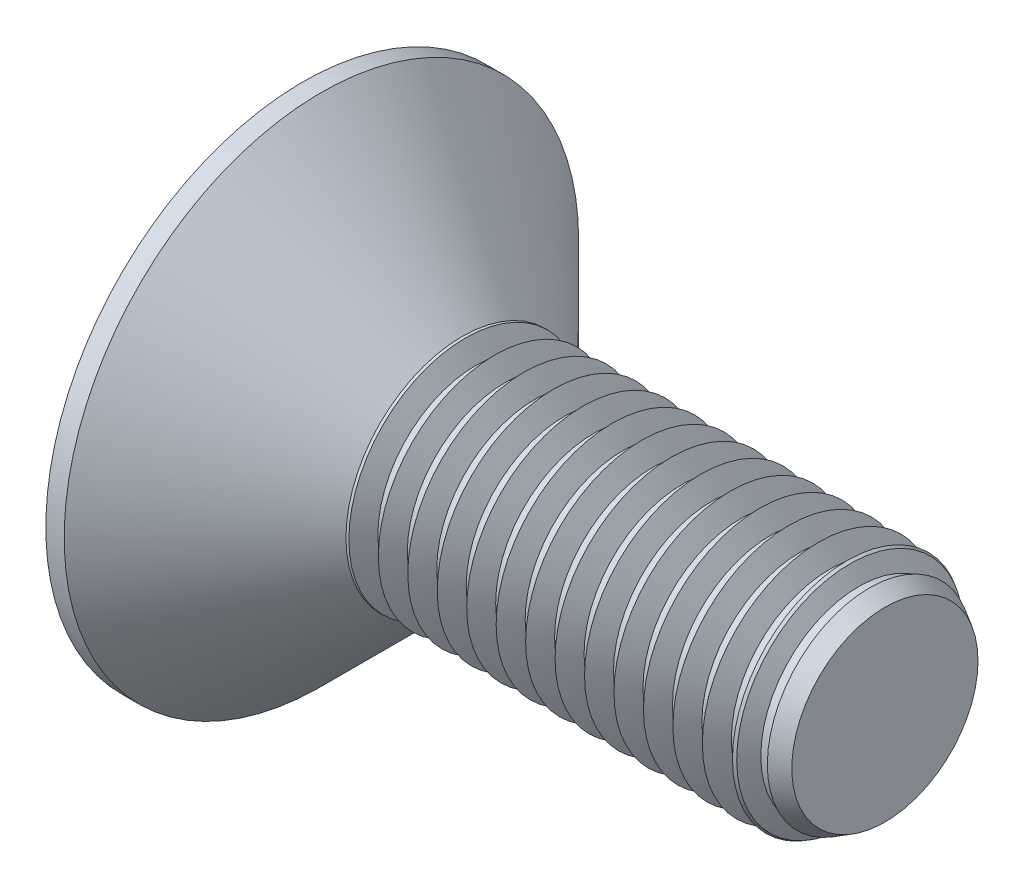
ISO-10303-21;
HEADER;
FILE_DESCRIPTION(('STEP AP214'),'2;1');
FILE_NAME('part.step','',(''),(''),'','','');
FILE_SCHEMA(('AUTOMOTIVE_DESIGN { 1 0 10303 214 1 1 1 1 }'));
ENDSEC;
DATA;
#1=APPLICATION_CONTEXT('core data for automotive mechanical design processes');
#2=APPLICATION_PROTOCOL_DEFINITION('international standard','automotive_design',2000,#1);
#3=PRODUCT_CONTEXT('',#1,'mechanical');
#4=PRODUCT('Part','Part','',(#3));
#5=PRODUCT_RELATED_PRODUCT_CATEGORY('part','',(#4));
#6=PRODUCT_DEFINITION_FORMATION('','',#4);
#7=PRODUCT_DEFINITION_CONTEXT('part definition',#1,'design');
#8=PRODUCT_DEFINITION('design','',#6,#7);
#9=PRODUCT_DEFINITION_SHAPE('','',#8);
#10=(LENGTH_UNIT() NAMED_UNIT(*) SI_UNIT(.MILLI.,.METRE.));
#11=(NAMED_UNIT(*) PLANE_ANGLE_UNIT() SI_UNIT($,.RADIAN.));
#12=(NAMED_UNIT(*) SI_UNIT($,.STERADIAN.) SOLID_ANGLE_UNIT());
#13=UNCERTAINTY_MEASURE_WITH_UNIT(LENGTH_MEASURE(1.E-05),#10,'distance_accuracy_value','');
#14=(GEOMETRIC_REPRESENTATION_CONTEXT(3) GLOBAL_UNCERTAINTY_ASSIGNED_CONTEXT((#13)) GLOBAL_UNIT_ASSIGNED_CONTEXT((#10,
#11,#12)) REPRESENTATION_CONTEXT('',''));
#15=CARTESIAN_POINT('',(0.,0.,0.));
#16=DIRECTION('',(0.,0.,1.));
#17=DIRECTION('',(1.,0.,0.));
#18=AXIS2_PLACEMENT_3D('',#15,#16,#17);
#19=CARTESIAN_POINT('',(0.,0.25,-0.25));
#20=DIRECTION('',(-0.139173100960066,-0.99026806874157,0.));
#21=DIRECTION('',(0.99026806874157,-0.139173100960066,0.));
#22=AXIS2_PLACEMENT_3D('',#19,#20,#21);
#23=PLANE('',#22);
#24=DIRECTION('',(-0.980814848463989,0.137844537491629,-0.137844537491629));
#25=VECTOR('',#24,1.);
#26=CARTESIAN_POINT('',(0.6,0.165675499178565,-0.204875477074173));
#27=LINE('',#26,#25);
#28=CARTESIAN_POINT('',(1.2,0.0813509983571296,-0.120550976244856));
#29=VERTEX_POINT('',#28);
#30=CARTESIAN_POINT('',(0.,0.25,-0.289199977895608));
#31=VERTEX_POINT('',#30);
#32=EDGE_CURVE('E211',#29,#31,#27,.T.);
#33=ORIENTED_EDGE('',*,*,#32,.T.);
#34=DIRECTION('',(0.,0.,-1.));
#35=VECTOR('',#34,1.);
#36=CARTESIAN_POINT('',(0.,0.25,-0.25));
#37=LINE('',#36,#35);
#38=CARTESIAN_POINT('',(0.,0.25,-1.));
#39=VERTEX_POINT('',#38);
#40=EDGE_CURVE('E223',#31,#39,#37,.T.);
#41=ORIENTED_EDGE('',*,*,#40,.T.);
#42=DIRECTION('',(-0.813777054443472,0.114368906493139,-0.569812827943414));
#43=VECTOR('',#42,1.);
#44=CARTESIAN_POINT('',(0.347775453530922,0.201123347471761,-0.756485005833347));
#45=LINE('',#44,#43);
#46=CARTESIAN_POINT('',(1.2,0.0813509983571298,-0.159750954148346));
#47=VERTEX_POINT('',#46);
#48=EDGE_CURVE('E308',#47,#39,#45,.T.);
#49=ORIENTED_EDGE('',*,*,#48,.F.);
#50=DIRECTION('',(0.,0.,1.));
#51=VECTOR('',#50,1.);
#52=CARTESIAN_POINT('',(1.2,0.0813509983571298,-0.25));
#53=LINE('',#52,#51);
#54=EDGE_CURVE('E12',#29,#47,#53,.F.);
#55=ORIENTED_EDGE('',*,*,#54,.F.);
#56=EDGE_LOOP('',(#33,#41,#49,#55));
#57=FACE_BOUND('',#56,.T.);
#58=ADVANCED_FACE('F90',(#57),#23,.T.);
#59=CARTESIAN_POINT('',(0.,-0.25,-0.25));
#60=DIRECTION('',(-0.139173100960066,0.99026806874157,0.));
#61=DIRECTION('',(-0.99026806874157,-0.139173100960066,0.));
#62=AXIS2_PLACEMENT_3D('',#59,#60,#61);
#63=PLANE('',#62);
#64=DIRECTION('',(-0.980814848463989,-0.137844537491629,-0.137844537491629));
#65=VECTOR('',#64,1.);
#66=CARTESIAN_POINT('',(1.2,-0.0813509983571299,-0.120550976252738));
#67=LINE('',#66,#65);
#68=CARTESIAN_POINT('',(1.2,-0.0813509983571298,-0.120550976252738));
#69=VERTEX_POINT('',#68);
#70=CARTESIAN_POINT('',(0.,-0.25,-0.289199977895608));
#71=VERTEX_POINT('',#70);
#72=EDGE_CURVE('E573',#69,#71,#67,.T.);
#73=ORIENTED_EDGE('',*,*,#72,.F.);
#74=DIRECTION('',(0.,0.,1.));
#75=VECTOR('',#74,1.);
#76=CARTESIAN_POINT('',(1.2,-0.0813509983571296,0.250000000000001));
#77=LINE('',#76,#75);
#78=CARTESIAN_POINT('',(1.2,-0.0813509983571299,-0.159750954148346));
#79=VERTEX_POINT('',#78);
#80=EDGE_CURVE('E105',#69,#79,#77,.F.);
#81=ORIENTED_EDGE('',*,*,#80,.T.);
#82=DIRECTION('',(-0.813777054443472,-0.114368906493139,-0.569812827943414));
#83=VECTOR('',#82,1.);
#84=CARTESIAN_POINT('',(0.0465353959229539,-0.243459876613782,-0.967415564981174));
#85=LINE('',#84,#83);
#86=CARTESIAN_POINT('',(0.,-0.25,-1.));
#87=VERTEX_POINT('',#86);
#88=EDGE_CURVE('E311',#79,#87,#85,.T.);
#89=ORIENTED_EDGE('',*,*,#88,.T.);
#90=DIRECTION('',(0.,0.,1.));
#91=VECTOR('',#90,1.);
#92=CARTESIAN_POINT('',(0.,-0.25,-0.25));
#93=LINE('',#92,#91);
#94=EDGE_CURVE('E249',#87,#71,#93,.T.);
#95=ORIENTED_EDGE('',*,*,#94,.T.);
#96=EDGE_LOOP('',(#73,#81,#89,#95));
#97=FACE_BOUND('',#96,.T.);
#98=ADVANCED_FACE('F487',(#97),#63,.T.);
#99=CARTESIAN_POINT('',(0.,-0.25,-0.25));
#100=DIRECTION('',(-0.139173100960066,0.,0.99026806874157));
#101=DIRECTION('',(0.99026806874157,0.,0.139173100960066));
#102=AXIS2_PLACEMENT_3D('',#99,#100,#101);
#103=PLANE('',#102);
#104=DIRECTION('',(-0.980814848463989,-0.137844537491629,-0.137844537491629));
#105=VECTOR('',#104,1.);
#106=CARTESIAN_POINT('',(0.6,-0.204875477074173,-0.165675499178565));
#107=LINE('',#106,#105);
#108=CARTESIAN_POINT('',(1.2,-0.120550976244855,-0.0813509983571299));
#109=VERTEX_POINT('',#108);
#110=CARTESIAN_POINT('',(0.,-0.289199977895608,-0.25));
#111=VERTEX_POINT('',#110);
#112=EDGE_CURVE('E580',#109,#111,#107,.T.);
#113=ORIENTED_EDGE('',*,*,#112,.T.);
#114=DIRECTION('',(0.,-1.,0.));
#115=VECTOR('',#114,1.);
#116=CARTESIAN_POINT('',(0.,-0.25,-0.25));
#117=LINE('',#116,#115);
#118=CARTESIAN_POINT('',(0.,-1.,-0.25));
#119=VERTEX_POINT('',#118);
#120=EDGE_CURVE('E256',#111,#119,#117,.T.);
#121=ORIENTED_EDGE('',*,*,#120,.T.);
#122=DIRECTION('',(-0.813777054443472,-0.569812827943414,-0.114368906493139));
#123=VECTOR('',#122,1.);
#124=CARTESIAN_POINT('',(0.347775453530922,-0.756485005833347,-0.201123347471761));
#125=LINE('',#124,#123);
#126=CARTESIAN_POINT('',(1.2,-0.159750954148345,-0.08135099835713));
#127=VERTEX_POINT('',#126);
#128=EDGE_CURVE('E302',#127,#119,#125,.T.);
#129=ORIENTED_EDGE('',*,*,#128,.F.);
#130=DIRECTION('',(0.,1.,0.));
#131=VECTOR('',#130,1.);
#132=CARTESIAN_POINT('',(1.2,-0.25,-0.08135099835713));
#133=LINE('',#132,#131);
#134=EDGE_CURVE('E283',#109,#127,#133,.F.);
#135=ORIENTED_EDGE('',*,*,#134,.F.);
#136=EDGE_LOOP('',(#113,#121,#129,#135));
#137=FACE_BOUND('',#136,.T.);
#138=ADVANCED_FACE('F492',(#137),#103,.T.);
#139=CARTESIAN_POINT('',(0.,-0.25,0.25));
#140=DIRECTION('',(-0.139173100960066,0.,-0.99026806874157));
#141=DIRECTION('',(-0.99026806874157,0.,0.139173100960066));
#142=AXIS2_PLACEMENT_3D('',#139,#140,#141);
#143=PLANE('',#142);
#144=DIRECTION('',(-0.980814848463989,-0.137844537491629,0.137844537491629));
#145=VECTOR('',#144,1.);
#146=CARTESIAN_POINT('',(1.2,-0.120550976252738,0.08135099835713));
#147=LINE('',#146,#145);
#148=CARTESIAN_POINT('',(1.2,-0.120550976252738,0.08135099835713));
#149=VERTEX_POINT('',#148);
#150=CARTESIAN_POINT('',(0.,-0.289199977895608,0.25));
#151=VERTEX_POINT('',#150);
#152=EDGE_CURVE('E590',#149,#151,#147,.T.);
#153=ORIENTED_EDGE('',*,*,#152,.F.);
#154=DIRECTION('',(0.,1.,0.));
#155=VECTOR('',#154,1.);
#156=CARTESIAN_POINT('',(1.2,1.,0.0813509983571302));
#157=LINE('',#156,#155);
#158=CARTESIAN_POINT('',(1.2,-0.159750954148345,0.08135099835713));
#159=VERTEX_POINT('',#158);
#160=EDGE_CURVE('E285',#149,#159,#157,.F.);
#161=ORIENTED_EDGE('',*,*,#160,.T.);
#162=DIRECTION('',(-0.813777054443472,-0.569812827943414,0.114368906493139));
#163=VECTOR('',#162,1.);
#164=CARTESIAN_POINT('',(0.0465353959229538,-0.967415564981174,0.243459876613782));
#165=LINE('',#164,#163);
#166=CARTESIAN_POINT('',(0.,-1.,0.25));
#167=VERTEX_POINT('',#166);
#168=EDGE_CURVE('E300',#159,#167,#165,.T.);
#169=ORIENTED_EDGE('',*,*,#168,.T.);
#170=DIRECTION('',(0.,1.,0.));
#171=VECTOR('',#170,1.);
#172=CARTESIAN_POINT('',(0.,-0.25,0.25));
#173=LINE('',#172,#171);
#174=EDGE_CURVE('E259',#167,#151,#173,.T.);
#175=ORIENTED_EDGE('',*,*,#174,.T.);
#176=EDGE_LOOP('',(#153,#161,#169,#175));
#177=FACE_BOUND('',#176,.T.);
#178=ADVANCED_FACE('F507',(#177),#143,.T.);
#179=CARTESIAN_POINT('',(0.,1.,-0.25));
#180=DIRECTION('',(-0.139173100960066,0.,0.99026806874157));
#181=DIRECTION('',(0.99026806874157,0.,0.139173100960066));
#182=AXIS2_PLACEMENT_3D('',#179,#180,#181);
#183=PLANE('',#182);
#184=DIRECTION('',(-0.980814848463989,0.137844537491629,-0.137844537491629));
#185=VECTOR('',#184,1.);
#186=CARTESIAN_POINT('',(1.2,0.120550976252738,-0.0813509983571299));
#187=LINE('',#186,#185);
#188=CARTESIAN_POINT('',(1.2,0.120550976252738,-0.0813509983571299));
#189=VERTEX_POINT('',#188);
#190=CARTESIAN_POINT('',(0.,0.289199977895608,-0.25));
#191=VERTEX_POINT('',#190);
#192=EDGE_CURVE('E201',#189,#191,#187,.T.);
#193=ORIENTED_EDGE('',*,*,#192,.F.);
#194=DIRECTION('',(0.,-1.,0.));
#195=VECTOR('',#194,1.);
#196=CARTESIAN_POINT('',(1.2,1.,-0.0813509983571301));
#197=LINE('',#196,#195);
#198=CARTESIAN_POINT('',(1.2,0.159750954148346,-0.08135099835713));
#199=VERTEX_POINT('',#198);
#200=EDGE_CURVE('E287',#189,#199,#197,.F.);
#201=ORIENTED_EDGE('',*,*,#200,.T.);
#202=DIRECTION('',(-0.813777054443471,0.569812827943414,-0.114368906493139));
#203=VECTOR('',#202,1.);
#204=CARTESIAN_POINT('',(0.,1.,-0.25));
#205=LINE('',#204,#203);
#206=CARTESIAN_POINT('',(0.,1.,-0.25));
#207=VERTEX_POINT('',#206);
#208=EDGE_CURVE('E230',#199,#207,#205,.T.);
#209=ORIENTED_EDGE('',*,*,#208,.T.);
#210=DIRECTION('',(0.,-1.,0.));
#211=VECTOR('',#210,1.);
#212=CARTESIAN_POINT('',(0.,1.,-0.25));
#213=LINE('',#212,#211);
#214=EDGE_CURVE('E221',#207,#191,#213,.T.);
#215=ORIENTED_EDGE('',*,*,#214,.T.);
#216=EDGE_LOOP('',(#193,#201,#209,#215));
#217=FACE_BOUND('',#216,.T.);
#218=ADVANCED_FACE('F92',(#217),#183,.T.);
#219=CARTESIAN_POINT('',(0.,0.25,0.25));
#220=DIRECTION('',(-0.139173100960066,-0.99026806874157,0.));
#221=DIRECTION('',(0.99026806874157,-0.139173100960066,0.));
#222=AXIS2_PLACEMENT_3D('',#219,#220,#221);
#223=PLANE('',#222);
#224=DIRECTION('',(-0.980814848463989,0.137844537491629,0.137844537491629));
#225=VECTOR('',#224,1.);
#226=CARTESIAN_POINT('',(1.2,0.0813509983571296,0.120550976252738));
#227=LINE('',#226,#225);
#228=CARTESIAN_POINT('',(1.2,0.0813509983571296,0.120550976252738));
#229=VERTEX_POINT('',#228);
#230=CARTESIAN_POINT('',(0.,0.25,0.289199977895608));
#231=VERTEX_POINT('',#230);
#232=EDGE_CURVE('E224',#229,#231,#227,.T.);
#233=ORIENTED_EDGE('',*,*,#232,.F.);
#234=DIRECTION('',(0.,0.,-1.));
#235=VECTOR('',#234,1.);
#236=CARTESIAN_POINT('',(1.2,0.0813509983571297,0.250000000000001));
#237=LINE('',#236,#235);
#238=CARTESIAN_POINT('',(1.2,0.0813509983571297,0.159750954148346));
#239=VERTEX_POINT('',#238);
#240=EDGE_CURVE('E291',#229,#239,#237,.F.);
#241=ORIENTED_EDGE('',*,*,#240,.T.);
#242=DIRECTION('',(-0.813777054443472,0.114368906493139,0.569812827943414));
#243=VECTOR('',#242,1.);
#244=CARTESIAN_POINT('',(0.,0.25,1.));
#245=LINE('',#244,#243);
#246=CARTESIAN_POINT('',(0.,0.25,1.));
#247=VERTEX_POINT('',#246);
#248=EDGE_CURVE('E299',#239,#247,#245,.T.);
#249=ORIENTED_EDGE('',*,*,#248,.T.);
#250=DIRECTION('',(0.,0.,-1.));
#251=VECTOR('',#250,1.);
#252=CARTESIAN_POINT('',(0.,0.25,0.25));
#253=LINE('',#252,#251);
#254=EDGE_CURVE('E272',#247,#231,#253,.T.);
#255=ORIENTED_EDGE('',*,*,#254,.T.);
#256=EDGE_LOOP('',(#233,#241,#249,#255));
#257=FACE_BOUND('',#256,.T.);
#258=ADVANCED_FACE('F496',(#257),#223,.T.);
#259=CARTESIAN_POINT('',(0.,-0.25,0.25));
#260=DIRECTION('',(-0.139173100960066,0.99026806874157,0.));
#261=DIRECTION('',(-0.99026806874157,-0.139173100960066,0.));
#262=AXIS2_PLACEMENT_3D('',#259,#260,#261);
#263=PLANE('',#262);
#264=DIRECTION('',(-0.980814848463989,-0.137844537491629,0.137844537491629));
#265=VECTOR('',#264,1.);
#266=CARTESIAN_POINT('',(0.6,-0.165675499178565,0.204875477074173));
#267=LINE('',#266,#265);
#268=CARTESIAN_POINT('',(1.2,-0.0813509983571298,0.120550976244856));
#269=VERTEX_POINT('',#268);
#270=CARTESIAN_POINT('',(0.,-0.25,0.289199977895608));
#271=VERTEX_POINT('',#270);
#272=EDGE_CURVE('E594',#269,#271,#267,.T.);
#273=ORIENTED_EDGE('',*,*,#272,.T.);
#274=DIRECTION('',(0.,0.,1.));
#275=VECTOR('',#274,1.);
#276=CARTESIAN_POINT('',(0.,-0.25,0.25));
#277=LINE('',#276,#275);
#278=CARTESIAN_POINT('',(0.,-0.25,1.));
#279=VERTEX_POINT('',#278);
#280=EDGE_CURVE('E263',#271,#279,#277,.T.);
#281=ORIENTED_EDGE('',*,*,#280,.T.);
#282=DIRECTION('',(-0.813777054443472,-0.114368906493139,0.569812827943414));
#283=VECTOR('',#282,1.);
#284=CARTESIAN_POINT('',(0.347775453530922,-0.201123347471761,0.756485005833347));
#285=LINE('',#284,#283);
#286=CARTESIAN_POINT('',(1.2,-0.08135099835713,0.159750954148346));
#287=VERTEX_POINT('',#286);
#288=EDGE_CURVE('E296',#287,#279,#285,.T.);
#289=ORIENTED_EDGE('',*,*,#288,.F.);
#290=DIRECTION('',(0.,0.,-1.));
#291=VECTOR('',#290,1.);
#292=CARTESIAN_POINT('',(1.2,-0.08135099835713,0.25));
#293=LINE('',#292,#291);
#294=EDGE_CURVE('E293',#269,#287,#293,.F.);
#295=ORIENTED_EDGE('',*,*,#294,.F.);
#296=EDGE_LOOP('',(#273,#281,#289,#295));
#297=FACE_BOUND('',#296,.T.);
#298=ADVANCED_FACE('F499',(#297),#263,.T.);
#299=CARTESIAN_POINT('',(1.2,1.,0.25));
#300=DIRECTION('',(1.,0.,0.));
#301=DIRECTION('',(0.,0.,-1.));
#302=AXIS2_PLACEMENT_3D('',#299,#300,#301);
#303=PLANE('',#302);
#304=ORIENTED_EDGE('',*,*,#200,.F.);
#305=CARTESIAN_POINT('',(1.2,0.120550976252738,-0.0813509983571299));
#306=CARTESIAN_POINT('',(1.2,0.118324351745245,-0.0813606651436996));
#307=CARTESIAN_POINT('',(1.2,0.116111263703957,-0.0815720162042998));
#308=CARTESIAN_POINT('',(1.2,0.111743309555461,-0.0823646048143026));
#309=CARTESIAN_POINT('',(1.2,0.109588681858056,-0.082947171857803));
#310=CARTESIAN_POINT('',(1.2,0.103317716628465,-0.0851865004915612));
#311=CARTESIAN_POINT('',(1.2,0.0993569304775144,-0.0873362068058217));
#312=CARTESIAN_POINT('',(1.2,0.0941198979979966,-0.0915159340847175));
#313=CARTESIAN_POINT('',(1.2,0.0924738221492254,-0.0930974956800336));
#314=CARTESIAN_POINT('',(1.2,0.0895058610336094,-0.0965413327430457));
#315=CARTESIAN_POINT('',(1.2,0.0881843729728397,-0.0984039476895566));
#316=CARTESIAN_POINT('',(1.2,0.0848976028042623,-0.103969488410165));
#317=CARTESIAN_POINT('',(1.2,0.0833172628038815,-0.107909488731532));
#318=CARTESIAN_POINT('',(1.2,0.0817208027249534,-0.114798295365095));
#319=CARTESIAN_POINT('',(1.2,0.0813709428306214,-0.117673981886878));
#320=CARTESIAN_POINT('',(1.2,0.0813509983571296,-0.120550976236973));
#321=B_SPLINE_CURVE_WITH_KNOTS('',3,(#305,#306,#307,#308,#309,#310,#311,#312,#313,#314,#315,
#316,#317,#318,#319,#320),.UNSPECIFIED.,.F.,.F.,(4,2,2,2,2,2,2,4),(0.,0.00664841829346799,
0.01332078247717,0.0265577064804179,0.0333690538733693,0.0401886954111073,0.0527076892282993,
0.0613307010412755),.UNSPECIFIED.);
#322=EDGE_CURVE('E94',#189,#29,#321,.T.);
#323=ORIENTED_EDGE('',*,*,#322,.T.);
#324=ORIENTED_EDGE('',*,*,#54,.T.);
#325=DIRECTION('',(0.,1.,0.));
#326=VECTOR('',#325,1.);
#327=CARTESIAN_POINT('',(1.2,0.25,-0.159750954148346));
#328=LINE('',#327,#326);
#329=EDGE_CURVE('E319',#47,#79,#328,.F.);
#330=ORIENTED_EDGE('',*,*,#329,.T.);
#331=ORIENTED_EDGE('',*,*,#80,.F.);
#332=CARTESIAN_POINT('',(1.2,-0.0813509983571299,-0.120550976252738));
#333=CARTESIAN_POINT('',(1.2,-0.0813606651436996,-0.118324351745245));
#334=CARTESIAN_POINT('',(1.2,-0.0815720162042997,-0.116111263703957));
#335=CARTESIAN_POINT('',(1.2,-0.0823646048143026,-0.111743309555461));
#336=CARTESIAN_POINT('',(1.2,-0.0829471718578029,-0.109588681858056));
#337=CARTESIAN_POINT('',(1.2,-0.0851865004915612,-0.103317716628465));
#338=CARTESIAN_POINT('',(1.2,-0.0873362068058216,-0.0993569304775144));
#339=CARTESIAN_POINT('',(1.2,-0.0915159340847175,-0.0941198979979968));
#340=CARTESIAN_POINT('',(1.2,-0.0930974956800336,-0.0924738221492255));
#341=CARTESIAN_POINT('',(1.2,-0.0965413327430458,-0.0895058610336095));
#342=CARTESIAN_POINT('',(1.2,-0.0984039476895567,-0.0881843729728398));
#343=CARTESIAN_POINT('',(1.2,-0.103969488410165,-0.0848976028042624));
#344=CARTESIAN_POINT('',(1.2,-0.107909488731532,-0.0833172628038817));
#345=CARTESIAN_POINT('',(1.2,-0.114798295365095,-0.0817208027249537));
#346=CARTESIAN_POINT('',(1.2,-0.117673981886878,-0.0813709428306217));
#347=CARTESIAN_POINT('',(1.2,-0.120550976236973,-0.0813509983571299));
#348=B_SPLINE_CURVE_WITH_KNOTS('',3,(#332,#333,#334,#335,#336,#337,#338,#339,#340,#341,#342,
#343,#344,#345,#346,#347),.UNSPECIFIED.,.F.,.F.,(4,2,2,2,2,2,2,4),(0.,0.00664841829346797,
0.01332078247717,0.0265577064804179,0.0333690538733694,0.0401886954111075,0.0527076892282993,
0.0613307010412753),.UNSPECIFIED.);
#349=EDGE_CURVE('E646',#69,#109,#348,.T.);
#350=ORIENTED_EDGE('',*,*,#349,.T.);
#351=ORIENTED_EDGE('',*,*,#134,.T.);
#352=DIRECTION('',(0.,0.,-1.));
#353=VECTOR('',#352,1.);
#354=CARTESIAN_POINT('',(1.2,-0.159750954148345,-0.25));
#355=LINE('',#354,#353);
#356=EDGE_CURVE('E322',#127,#159,#355,.F.);
#357=ORIENTED_EDGE('',*,*,#356,.T.);
#358=ORIENTED_EDGE('',*,*,#160,.F.);
#359=CARTESIAN_POINT('',(1.2,-0.120550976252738,0.08135099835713));
#360=CARTESIAN_POINT('',(1.2,-0.118324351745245,0.0813606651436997));
#361=CARTESIAN_POINT('',(1.2,-0.116111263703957,0.0815720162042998));
#362=CARTESIAN_POINT('',(1.2,-0.111743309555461,0.0823646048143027));
#363=CARTESIAN_POINT('',(1.2,-0.109588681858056,0.082947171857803));
#364=CARTESIAN_POINT('',(1.2,-0.103317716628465,0.0851865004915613));
#365=CARTESIAN_POINT('',(1.2,-0.0993569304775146,0.0873362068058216));
#366=CARTESIAN_POINT('',(1.2,-0.094119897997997,0.0915159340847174));
#367=CARTESIAN_POINT('',(1.2,-0.0924738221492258,0.0930974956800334));
#368=CARTESIAN_POINT('',(1.2,-0.0895058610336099,0.0965413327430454));
#369=CARTESIAN_POINT('',(1.2,-0.0881843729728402,0.0984039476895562));
#370=CARTESIAN_POINT('',(1.2,-0.0848976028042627,0.103969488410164));
#371=CARTESIAN_POINT('',(1.2,-0.083317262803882,0.107909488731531));
#372=CARTESIAN_POINT('',(1.2,-0.0817208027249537,0.114798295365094));
#373=CARTESIAN_POINT('',(1.2,-0.0813709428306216,0.117673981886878));
#374=CARTESIAN_POINT('',(1.2,-0.0813509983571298,0.120550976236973));
#375=B_SPLINE_CURVE_WITH_KNOTS('',3,(#359,#360,#361,#362,#363,#364,#365,#366,#367,#368,#369,
#370,#371,#372,#373,#374),.UNSPECIFIED.,.F.,.F.,(4,2,2,2,2,2,2,4),(0.,0.00664841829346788,
0.0133207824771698,0.0265577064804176,0.0333690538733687,0.0401886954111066,0.0527076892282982,
0.0613307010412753),.UNSPECIFIED.);
#376=EDGE_CURVE('E651',#149,#269,#375,.T.);
#377=ORIENTED_EDGE('',*,*,#376,.T.);
#378=ORIENTED_EDGE('',*,*,#294,.T.);
#379=DIRECTION('',(0.,-1.,0.));
#380=VECTOR('',#379,1.);
#381=CARTESIAN_POINT('',(1.2,0.25,0.159750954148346));
#382=LINE('',#381,#380);
#383=EDGE_CURVE('E313',#287,#239,#382,.F.);
#384=ORIENTED_EDGE('',*,*,#383,.T.);
#385=ORIENTED_EDGE('',*,*,#240,.F.);
#386=CARTESIAN_POINT('',(1.2,0.0813509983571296,0.120550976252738));
#387=CARTESIAN_POINT('',(1.2,0.0813606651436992,0.118324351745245));
#388=CARTESIAN_POINT('',(1.2,0.0815720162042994,0.116111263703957));
#389=CARTESIAN_POINT('',(1.2,0.0823646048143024,0.111743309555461));
#390=CARTESIAN_POINT('',(1.2,0.0829471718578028,0.109588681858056));
#391=CARTESIAN_POINT('',(1.2,0.0851865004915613,0.103317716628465));
#392=CARTESIAN_POINT('',(1.2,0.0873362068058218,0.0993569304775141));
#393=CARTESIAN_POINT('',(1.2,0.0915159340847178,0.0941198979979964));
#394=CARTESIAN_POINT('',(1.2,0.0930974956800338,0.0924738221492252));
#395=CARTESIAN_POINT('',(1.2,0.0965413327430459,0.0895058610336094));
#396=CARTESIAN_POINT('',(1.2,0.0984039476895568,0.0881843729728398));
#397=CARTESIAN_POINT('',(1.2,0.103969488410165,0.0848976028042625));
#398=CARTESIAN_POINT('',(1.2,0.107909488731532,0.0833172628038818));
#399=CARTESIAN_POINT('',(1.2,0.114798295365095,0.0817208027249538));
#400=CARTESIAN_POINT('',(1.2,0.117673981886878,0.0813709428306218));
#401=CARTESIAN_POINT('',(1.2,0.120550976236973,0.08135099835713));
#402=B_SPLINE_CURVE_WITH_KNOTS('',3,(#386,#387,#388,#389,#390,#391,#392,#393,#394,#395,#396,
#397,#398,#399,#400,#401),.UNSPECIFIED.,.F.,.F.,(4,2,2,2,2,2,2,4),(0.,0.00664841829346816,
0.0133207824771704,0.0265577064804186,0.0333690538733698,0.0401886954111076,0.0527076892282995,
0.0613307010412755),.UNSPECIFIED.);
#403=CARTESIAN_POINT('',(1.2,0.120550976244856,0.08135099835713));
#404=VERTEX_POINT('',#403);
#405=EDGE_CURVE('E662',#229,#404,#402,.T.);
#406=ORIENTED_EDGE('',*,*,#405,.T.);
#407=DIRECTION('',(0.,-1.,0.));
#408=VECTOR('',#407,1.);
#409=CARTESIAN_POINT('',(1.2,1.,0.0813509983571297));
#410=LINE('',#409,#408);
#411=CARTESIAN_POINT('',(1.2,0.159750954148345,0.08135099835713));
#412=VERTEX_POINT('',#411);
#413=EDGE_CURVE('E289',#404,#412,#410,.F.);
#414=ORIENTED_EDGE('',*,*,#413,.T.);
#415=DIRECTION('',(0.,0.,1.));
#416=VECTOR('',#415,1.);
#417=CARTESIAN_POINT('',(1.2,0.159750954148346,-0.250000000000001));
#418=LINE('',#417,#416);
#419=EDGE_CURVE('E280',#412,#199,#418,.F.);
#420=ORIENTED_EDGE('',*,*,#419,.T.);
#421=EDGE_LOOP('',(#304,#323,#324,#330,#331,#350,#351,#357,#358,#377,#378,#384,#385,#406,#414,#420));
#422=FACE_BOUND('',#421,.T.);
#423=ADVANCED_FACE('F505',(#422),#303,.F.);
#424=CARTESIAN_POINT('',(0.,1.,0.25));
#425=DIRECTION('',(-0.139173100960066,0.,-0.99026806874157));
#426=DIRECTION('',(-0.99026806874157,0.,0.139173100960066));
#427=AXIS2_PLACEMENT_3D('',#424,#425,#426);
#428=PLANE('',#427);
#429=ORIENTED_EDGE('',*,*,#413,.F.);
#430=DIRECTION('',(-0.980814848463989,0.137844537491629,0.137844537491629));
#431=VECTOR('',#430,1.);
#432=CARTESIAN_POINT('',(1.2,0.120550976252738,0.08135099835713));
#433=LINE('',#432,#431);
#434=CARTESIAN_POINT('',(0.,0.289199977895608,0.25));
#435=VERTEX_POINT('',#434);
#436=EDGE_CURVE('E210',#404,#435,#433,.T.);
#437=ORIENTED_EDGE('',*,*,#436,.T.);
#438=DIRECTION('',(0.,1.,0.));
#439=VECTOR('',#438,1.);
#440=CARTESIAN_POINT('',(0.,1.,0.25));
#441=LINE('',#440,#439);
#442=CARTESIAN_POINT('',(0.,1.,0.25));
#443=VERTEX_POINT('',#442);
#444=EDGE_CURVE('E279',#435,#443,#441,.T.);
#445=ORIENTED_EDGE('',*,*,#444,.T.);
#446=DIRECTION('',(-0.813777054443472,0.569812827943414,0.114368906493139));
#447=VECTOR('',#446,1.);
#448=CARTESIAN_POINT('',(0.,1.,0.25));
#449=LINE('',#448,#447);
#450=EDGE_CURVE('E303',#412,#443,#449,.T.);
#451=ORIENTED_EDGE('',*,*,#450,.F.);
#452=EDGE_LOOP('',(#429,#437,#445,#451));
#453=FACE_BOUND('',#452,.T.);
#454=ADVANCED_FACE('F501',(#453),#428,.T.);
#455=CARTESIAN_POINT('',(0.,-1.,-0.25));
#456=DIRECTION('',(-0.573576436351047,0.819152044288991,0.));
#457=DIRECTION('',(-0.819152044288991,-0.573576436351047,0.));
#458=AXIS2_PLACEMENT_3D('',#455,#456,#457);
#459=PLANE('',#458);
#460=ORIENTED_EDGE('',*,*,#168,.F.);
#461=ORIENTED_EDGE('',*,*,#356,.F.);
#462=ORIENTED_EDGE('',*,*,#128,.T.);
#463=DIRECTION('',(0.,0.,1.));
#464=VECTOR('',#463,1.);
#465=CARTESIAN_POINT('',(0.,-1.,-0.25));
#466=LINE('',#465,#464);
#467=EDGE_CURVE('E258',#119,#167,#466,.T.);
#468=ORIENTED_EDGE('',*,*,#467,.T.);
#469=EDGE_LOOP('',(#460,#461,#462,#468));
#470=FACE_BOUND('',#469,.T.);
#471=ADVANCED_FACE('F504',(#470),#459,.T.);
#472=CARTESIAN_POINT('',(0.,0.25,1.));
#473=DIRECTION('',(-0.573576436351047,0.,-0.819152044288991));
#474=DIRECTION('',(-0.819152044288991,0.,0.573576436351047));
#475=AXIS2_PLACEMENT_3D('',#472,#473,#474);
#476=PLANE('',#475);
#477=ORIENTED_EDGE('',*,*,#383,.F.);
#478=ORIENTED_EDGE('',*,*,#288,.T.);
#479=DIRECTION('',(0.,1.,0.));
#480=VECTOR('',#479,1.);
#481=CARTESIAN_POINT('',(0.,0.25,1.));
#482=LINE('',#481,#480);
#483=EDGE_CURVE('E269',#279,#247,#482,.T.);
#484=ORIENTED_EDGE('',*,*,#483,.T.);
#485=ORIENTED_EDGE('',*,*,#248,.F.);
#486=EDGE_LOOP('',(#477,#478,#484,#485));
#487=FACE_BOUND('',#486,.T.);
#488=ADVANCED_FACE('F519',(#487),#476,.T.);
#489=CARTESIAN_POINT('',(0.,0.25,-1.));
#490=DIRECTION('',(-0.573576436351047,0.,0.819152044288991));
#491=DIRECTION('',(0.819152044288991,0.,0.573576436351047));
#492=AXIS2_PLACEMENT_3D('',#489,#490,#491);
#493=PLANE('',#492);
#494=ORIENTED_EDGE('',*,*,#88,.F.);
#495=ORIENTED_EDGE('',*,*,#329,.F.);
#496=ORIENTED_EDGE('',*,*,#48,.T.);
#497=DIRECTION('',(0.,-1.,0.));
#498=VECTOR('',#497,1.);
#499=CARTESIAN_POINT('',(0.,0.25,-1.));
#500=LINE('',#499,#498);
#501=EDGE_CURVE('E234',#39,#87,#500,.T.);
#502=ORIENTED_EDGE('',*,*,#501,.T.);
#503=EDGE_LOOP('',(#494,#495,#496,#502));
#504=FACE_BOUND('',#503,.T.);
#505=ADVANCED_FACE('F521',(#504),#493,.T.);
#506=CARTESIAN_POINT('',(0.,1.,-0.25));
#507=DIRECTION('',(-0.573576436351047,-0.819152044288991,0.));
#508=DIRECTION('',(0.819152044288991,-0.573576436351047,0.));
#509=AXIS2_PLACEMENT_3D('',#506,#507,#508);
#510=PLANE('',#509);
#511=ORIENTED_EDGE('',*,*,#419,.F.);
#512=ORIENTED_EDGE('',*,*,#450,.T.);
#513=DIRECTION('',(0.,0.,-1.));
#514=VECTOR('',#513,1.);
#515=CARTESIAN_POINT('',(0.,1.,-0.25));
#516=LINE('',#515,#514);
#517=EDGE_CURVE('E232',#443,#207,#516,.T.);
#518=ORIENTED_EDGE('',*,*,#517,.T.);
#519=ORIENTED_EDGE('',*,*,#208,.F.);
#520=EDGE_LOOP('',(#511,#512,#518,#519));
#521=FACE_BOUND('',#520,.T.);
#522=ADVANCED_FACE('F524',(#521),#510,.T.);
#523=CARTESIAN_POINT('',(9.5,0.,0.));
#524=DIRECTION('',(-1.,0.,0.));
#525=DIRECTION('',(0.,0.,1.));
#526=AXIS2_PLACEMENT_3D('',#523,#524,#525);
#527=CONICAL_SURFACE('',#526,1.52,0.523598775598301);
#528=CARTESIAN_POINT('',(8.88569173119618,0.,0.));
#529=DIRECTION('',(1.,0.,0.));
#530=DIRECTION('',(0.,0.,-1.));
#531=AXIS2_PLACEMENT_3D('',#528,#529,#530);
#532=CIRCLE('',#531,1.8746710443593);
#533=CARTESIAN_POINT('',(8.88569173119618,0.,-1.8746710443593));
#534=VERTEX_POINT('',#533);
#535=EDGE_CURVE('E335',#534,#534,#532,.T.);
#536=ORIENTED_EDGE('',*,*,#535,.T.);
#537=EDGE_LOOP('',(#536));
#538=FACE_BOUND('',#537,.T.);
#539=CARTESIAN_POINT('',(8.92956276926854,0.,0.));
#540=DIRECTION('',(-1.,0.,0.));
#541=DIRECTION('',(0.,0.,1.));
#542=AXIS2_PLACEMENT_3D('',#539,#540,#541);
#543=CIRCLE('',#542,1.84934208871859);
#544=CARTESIAN_POINT('',(8.92956276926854,0.,1.84934208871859));
#545=VERTEX_POINT('',#544);
#546=EDGE_CURVE('E331',#545,#545,#543,.T.);
#547=ORIENTED_EDGE('',*,*,#546,.T.);
#548=EDGE_LOOP('',(#547));
#549=FACE_BOUND('',#548,.T.);
#550=ADVANCED_FACE('F528',(#538,#549),#527,.T.);
#551=CARTESIAN_POINT('',(6.62068469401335,0.,0.));
#552=DIRECTION('',(1.,0.,0.));
#553=DIRECTION('',(0.,0.,-1.));
#554=AXIS2_PLACEMENT_3D('',#551,#552,#553);
#555=CYLINDRICAL_SURFACE('',#554,1.9);
#556=CARTESIAN_POINT('',(2.6,0.,0.));
#557=DIRECTION('',(1.,0.,0.));
#558=DIRECTION('',(0.,0.,-1.));
#559=AXIS2_PLACEMENT_3D('',#556,#557,#558);
#560=CIRCLE('',#559,1.9);
#561=CARTESIAN_POINT('',(2.6,0.,-1.9));
#562=VERTEX_POINT('',#561);
#563=EDGE_CURVE('E348',#562,#562,#560,.T.);
#564=ORIENTED_EDGE('',*,*,#563,.T.);
#565=EDGE_LOOP('',(#564));
#566=FACE_BOUND('',#565,.T.);
#567=CARTESIAN_POINT('',(2.64809401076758,0.,0.));
#568=DIRECTION('',(-1.,0.,0.));
#569=DIRECTION('',(0.,0.,1.));
#570=AXIS2_PLACEMENT_3D('',#567,#568,#569);
#571=CIRCLE('',#570,1.9);
#572=CARTESIAN_POINT('',(2.64809401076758,0.,1.9));
#573=VERTEX_POINT('',#572);
#574=EDGE_CURVE('E357',#573,#573,#571,.T.);
#575=ORIENTED_EDGE('',*,*,#574,.T.);
#576=EDGE_LOOP('',(#575));
#577=FACE_BOUND('',#576,.T.);
#578=ADVANCED_FACE('F542',(#566,#577),#555,.T.);
#579=CARTESIAN_POINT('',(0.,0.,0.));
#580=DIRECTION('',(-1.,0.,0.));
#581=DIRECTION('',(0.,0.,1.));
#582=AXIS2_PLACEMENT_3D('',#579,#580,#581);
#583=PLANE('',#582);
#584=CARTESIAN_POINT('',(0.,0.289199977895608,0.289199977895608));
#585=DIRECTION('',(1.,0.,0.));
#586=DIRECTION('',(0.,0.,1.));
#587=AXIS2_PLACEMENT_3D('',#584,#585,#586);
#588=CIRCLE('',#587,0.039199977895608);
#589=EDGE_CURVE('E673',#231,#435,#588,.T.);
#590=ORIENTED_EDGE('',*,*,#589,.F.);
#591=ORIENTED_EDGE('',*,*,#254,.F.);
#592=ORIENTED_EDGE('',*,*,#483,.F.);
#593=ORIENTED_EDGE('',*,*,#280,.F.);
#594=CARTESIAN_POINT('',(0.,-0.289199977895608,0.289199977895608));
#595=DIRECTION('',(1.,0.,0.));
#596=DIRECTION('',(0.,0.,1.));
#597=AXIS2_PLACEMENT_3D('',#594,#595,#596);
#598=CIRCLE('',#597,0.0391999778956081);
#599=EDGE_CURVE('E570',#151,#271,#598,.T.);
#600=ORIENTED_EDGE('',*,*,#599,.F.);
#601=ORIENTED_EDGE('',*,*,#174,.F.);
#602=ORIENTED_EDGE('',*,*,#467,.F.);
#603=ORIENTED_EDGE('',*,*,#120,.F.);
#604=CARTESIAN_POINT('',(0.,-0.289199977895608,-0.289199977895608));
#605=DIRECTION('',(1.,0.,0.));
#606=DIRECTION('',(0.,0.,-1.));
#607=AXIS2_PLACEMENT_3D('',#604,#605,#606);
#608=CIRCLE('',#607,0.039199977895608);
#609=EDGE_CURVE('E225',#71,#111,#608,.T.);
#610=ORIENTED_EDGE('',*,*,#609,.F.);
#611=ORIENTED_EDGE('',*,*,#94,.F.);
#612=ORIENTED_EDGE('',*,*,#501,.F.);
#613=ORIENTED_EDGE('',*,*,#40,.F.);
#614=CARTESIAN_POINT('',(0.,0.289199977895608,-0.289199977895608));
#615=DIRECTION('',(1.,0.,0.));
#616=DIRECTION('',(0.,0.,-1.));
#617=AXIS2_PLACEMENT_3D('',#614,#615,#616);
#618=CIRCLE('',#617,0.0391999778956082);
#619=EDGE_CURVE('E204',#191,#31,#618,.T.);
#620=ORIENTED_EDGE('',*,*,#619,.F.);
#621=ORIENTED_EDGE('',*,*,#214,.F.);
#622=ORIENTED_EDGE('',*,*,#517,.F.);
#623=ORIENTED_EDGE('',*,*,#444,.F.);
#624=EDGE_LOOP('',(#590,#591,#592,#593,#600,#601,#602,#603,#610,#611,#612,#613,#620,#621,#622,#623));
#625=FACE_BOUND('',#624,.T.);
#626=CARTESIAN_POINT('',(0.,0.,0.));
#627=DIRECTION('',(1.,0.,0.));
#628=DIRECTION('',(0.,0.,-1.));
#629=AXIS2_PLACEMENT_3D('',#626,#627,#628);
#630=CIRCLE('',#629,4.2);
#631=CARTESIAN_POINT('',(0.,0.,-4.2));
#632=VERTEX_POINT('',#631);
#633=EDGE_CURVE('E342',#632,#632,#630,.T.);
#634=ORIENTED_EDGE('',*,*,#633,.F.);
#635=EDGE_LOOP('',(#634));
#636=FACE_BOUND('',#635,.T.);
#637=ADVANCED_FACE('F218',(#625,#636),#583,.T.);
#638=CARTESIAN_POINT('',(6.62068469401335,0.,0.));
#639=DIRECTION('',(1.,0.,0.));
#640=DIRECTION('',(0.,0.,-1.));
#641=AXIS2_PLACEMENT_3D('',#638,#639,#640);
#642=CYLINDRICAL_SURFACE('',#641,4.2);
#643=ORIENTED_EDGE('',*,*,#633,.T.);
#644=EDGE_LOOP('',(#643));
#645=FACE_BOUND('',#644,.T.);
#646=CARTESIAN_POINT('',(0.29999999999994,0.,0.));
#647=DIRECTION('',(1.,0.,0.));
#648=DIRECTION('',(0.,0.,-1.));
#649=AXIS2_PLACEMENT_3D('',#646,#647,#648);
#650=CIRCLE('',#649,4.2);
#651=CARTESIAN_POINT('',(0.29999999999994,0.,-4.2));
#652=VERTEX_POINT('',#651);
#653=EDGE_CURVE('E345',#652,#652,#650,.T.);
#654=ORIENTED_EDGE('',*,*,#653,.F.);
#655=EDGE_LOOP('',(#654));
#656=FACE_BOUND('',#655,.T.);
#657=ADVANCED_FACE('F541',(#645,#656),#642,.T.);
#658=CARTESIAN_POINT('',(2.6,0.,0.));
#659=DIRECTION('',(-1.,0.,0.));
#660=DIRECTION('',(0.,0.,1.));
#661=AXIS2_PLACEMENT_3D('',#658,#659,#660);
#662=CONICAL_SURFACE('',#661,1.9,0.785398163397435);
#663=ORIENTED_EDGE('',*,*,#653,.T.);
#664=EDGE_LOOP('',(#663));
#665=FACE_BOUND('',#664,.T.);
#666=ORIENTED_EDGE('',*,*,#563,.F.);
#667=EDGE_LOOP('',(#666));
#668=FACE_BOUND('',#667,.T.);
#669=ADVANCED_FACE('F1117',(#665,#668),#662,.T.);
#670=CARTESIAN_POINT('',(2.95582903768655,0.,0.));
#671=DIRECTION('',(1.,0.,0.));
#672=DIRECTION('',(0.,0.,-1.));
#673=AXIS2_PLACEMENT_3D('',#670,#671,#672);
#674=CONICAL_SURFACE('',#673,1.6,1.0471975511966);
#675=CARTESIAN_POINT('',(3.12903411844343,0.,0.));
#676=DIRECTION('',(-1.,0.,0.));
#677=DIRECTION('',(0.,0.,1.));
#678=AXIS2_PLACEMENT_3D('',#675,#676,#677);
#679=CIRCLE('',#678,1.9);
#680=CARTESIAN_POINT('',(3.12903411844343,0.,1.9));
#681=VERTEX_POINT('',#680);
#682=EDGE_CURVE('E366',#681,#681,#679,.T.);
#683=ORIENTED_EDGE('',*,*,#682,.T.);
#684=EDGE_LOOP('',(#683));
#685=FACE_BOUND('',#684,.T.);
#686=CARTESIAN_POINT('',(2.95582903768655,0.,0.));
#687=DIRECTION('',(-1.,0.,0.));
#688=DIRECTION('',(0.,0.,1.));
#689=AXIS2_PLACEMENT_3D('',#686,#687,#688);
#690=CIRCLE('',#689,1.6);
#691=CARTESIAN_POINT('',(2.95582903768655,0.,1.6));
#692=VERTEX_POINT('',#691);
#693=EDGE_CURVE('E351',#692,#692,#690,.T.);
#694=ORIENTED_EDGE('',*,*,#693,.F.);
#695=EDGE_LOOP('',(#694));
#696=FACE_BOUND('',#695,.T.);
#697=ADVANCED_FACE('F1114',(#685,#696),#674,.T.);
#698=CARTESIAN_POINT('',(0.,0.,0.));
#699=DIRECTION('',(-1.,0.,0.));
#700=DIRECTION('',(0.,0.,1.));
#701=AXIS2_PLACEMENT_3D('',#698,#699,#700);
#702=CYLINDRICAL_SURFACE('',#701,1.6);
#703=ORIENTED_EDGE('',*,*,#693,.T.);
#704=EDGE_LOOP('',(#703));
#705=FACE_BOUND('',#704,.T.);
#706=CARTESIAN_POINT('',(2.82129909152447,0.,0.));
#707=DIRECTION('',(-1.,0.,0.));
#708=DIRECTION('',(0.,0.,1.));
#709=AXIS2_PLACEMENT_3D('',#706,#707,#708);
#710=CIRCLE('',#709,1.6);
#711=CARTESIAN_POINT('',(2.82129909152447,0.,1.6));
#712=VERTEX_POINT('',#711);
#713=EDGE_CURVE('E354',#712,#712,#710,.T.);
#714=ORIENTED_EDGE('',*,*,#713,.F.);
#715=EDGE_LOOP('',(#714));
#716=FACE_BOUND('',#715,.T.);
#717=ADVANCED_FACE('F1110',(#705,#716),#702,.T.);
#718=CARTESIAN_POINT('',(2.64809401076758,0.,0.));
#719=DIRECTION('',(-1.,0.,0.));
#720=DIRECTION('',(0.,0.,1.));
#721=AXIS2_PLACEMENT_3D('',#718,#719,#720);
#722=CONICAL_SURFACE('',#721,1.9,1.0471975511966);
#723=ORIENTED_EDGE('',*,*,#713,.T.);
#724=EDGE_LOOP('',(#723));
#725=FACE_BOUND('',#724,.T.);
#726=ORIENTED_EDGE('',*,*,#574,.F.);
#727=EDGE_LOOP('',(#726));
#728=FACE_BOUND('',#727,.T.);
#729=ADVANCED_FACE('F1083',(#725,#728),#722,.T.);
#730=CARTESIAN_POINT('',(3.4367691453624,0.,0.));
#731=DIRECTION('',(1.,0.,0.));
#732=DIRECTION('',(0.,0.,-1.));
#733=AXIS2_PLACEMENT_3D('',#730,#731,#732);
#734=CONICAL_SURFACE('',#733,1.6,1.0471975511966);
#735=CARTESIAN_POINT('',(3.60997422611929,0.,0.));
#736=DIRECTION('',(-1.,0.,0.));
#737=DIRECTION('',(0.,0.,1.));
#738=AXIS2_PLACEMENT_3D('',#735,#736,#737);
#739=CIRCLE('',#738,1.9);
#740=CARTESIAN_POINT('',(3.60997422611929,0.,1.9));
#741=VERTEX_POINT('',#740);
#742=EDGE_CURVE('E375',#741,#741,#739,.T.);
#743=ORIENTED_EDGE('',*,*,#742,.T.);
#744=EDGE_LOOP('',(#743));
#745=FACE_BOUND('',#744,.T.);
#746=CARTESIAN_POINT('',(3.4367691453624,0.,0.));
#747=DIRECTION('',(-1.,0.,0.));
#748=DIRECTION('',(0.,0.,1.));
#749=AXIS2_PLACEMENT_3D('',#746,#747,#748);
#750=CIRCLE('',#749,1.6);
#751=CARTESIAN_POINT('',(3.4367691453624,0.,1.6));
#752=VERTEX_POINT('',#751);
#753=EDGE_CURVE('E360',#752,#752,#750,.T.);
#754=ORIENTED_EDGE('',*,*,#753,.F.);
#755=EDGE_LOOP('',(#754));
#756=FACE_BOUND('',#755,.T.);
#757=ADVANCED_FACE('F985',(#745,#756),#734,.T.);
#758=CARTESIAN_POINT('',(0.48094010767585,0.,0.));
#759=DIRECTION('',(-1.,0.,0.));
#760=DIRECTION('',(0.,0.,1.));
#761=AXIS2_PLACEMENT_3D('',#758,#759,#760);
#762=CYLINDRICAL_SURFACE('',#761,1.6);
#763=ORIENTED_EDGE('',*,*,#753,.T.);
#764=EDGE_LOOP('',(#763));
#765=FACE_BOUND('',#764,.T.);
#766=CARTESIAN_POINT('',(3.30223919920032,0.,0.));
#767=DIRECTION('',(-1.,0.,0.));
#768=DIRECTION('',(0.,0.,1.));
#769=AXIS2_PLACEMENT_3D('',#766,#767,#768);
#770=CIRCLE('',#769,1.6);
#771=CARTESIAN_POINT('',(3.30223919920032,0.,1.6));
#772=VERTEX_POINT('',#771);
#773=EDGE_CURVE('E363',#772,#772,#770,.T.);
#774=ORIENTED_EDGE('',*,*,#773,.F.);
#775=EDGE_LOOP('',(#774));
#776=FACE_BOUND('',#775,.T.);
#777=ADVANCED_FACE('F857',(#765,#776),#762,.T.);
#778=CARTESIAN_POINT('',(3.12903411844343,0.,0.));
#779=DIRECTION('',(-1.,0.,0.));
#780=DIRECTION('',(0.,0.,1.));
#781=AXIS2_PLACEMENT_3D('',#778,#779,#780);
#782=CONICAL_SURFACE('',#781,1.9,1.0471975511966);
#783=ORIENTED_EDGE('',*,*,#773,.T.);
#784=EDGE_LOOP('',(#783));
#785=FACE_BOUND('',#784,.T.);
#786=ORIENTED_EDGE('',*,*,#682,.F.);
#787=EDGE_LOOP('',(#786));
#788=FACE_BOUND('',#787,.T.);
#789=ADVANCED_FACE('F851',(#785,#788),#782,.T.);
#790=CARTESIAN_POINT('',(3.91770925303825,0.,0.));
#791=DIRECTION('',(1.,0.,0.));
#792=DIRECTION('',(0.,0.,-1.));
#793=AXIS2_PLACEMENT_3D('',#790,#791,#792);
#794=CONICAL_SURFACE('',#793,1.6,1.0471975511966);
#795=CARTESIAN_POINT('',(4.09091433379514,0.,0.));
#796=DIRECTION('',(-1.,0.,0.));
#797=DIRECTION('',(0.,0.,1.));
#798=AXIS2_PLACEMENT_3D('',#795,#796,#797);
#799=CIRCLE('',#798,1.9);
#800=CARTESIAN_POINT('',(4.09091433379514,0.,1.9));
#801=VERTEX_POINT('',#800);
#802=EDGE_CURVE('E384',#801,#801,#799,.T.);
#803=ORIENTED_EDGE('',*,*,#802,.T.);
#804=EDGE_LOOP('',(#803));
#805=FACE_BOUND('',#804,.T.);
#806=CARTESIAN_POINT('',(3.91770925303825,0.,0.));
#807=DIRECTION('',(-1.,0.,0.));
#808=DIRECTION('',(0.,0.,1.));
#809=AXIS2_PLACEMENT_3D('',#806,#807,#808);
#810=CIRCLE('',#809,1.6);
#811=CARTESIAN_POINT('',(3.91770925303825,0.,1.6));
#812=VERTEX_POINT('',#811);
#813=EDGE_CURVE('E369',#812,#812,#810,.T.);
#814=ORIENTED_EDGE('',*,*,#813,.F.);
#815=EDGE_LOOP('',(#814));
#816=FACE_BOUND('',#815,.T.);
#817=ADVANCED_FACE('F856',(#805,#816),#794,.T.);
#818=CARTESIAN_POINT('',(0.9618802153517,0.,0.));
#819=DIRECTION('',(-1.,0.,0.));
#820=DIRECTION('',(0.,0.,1.));
#821=AXIS2_PLACEMENT_3D('',#818,#819,#820);
#822=CYLINDRICAL_SURFACE('',#821,1.6);
#823=ORIENTED_EDGE('',*,*,#813,.T.);
#824=EDGE_LOOP('',(#823));
#825=FACE_BOUND('',#824,.T.);
#826=CARTESIAN_POINT('',(3.78317930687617,0.,0.));
#827=DIRECTION('',(-1.,0.,0.));
#828=DIRECTION('',(0.,0.,1.));
#829=AXIS2_PLACEMENT_3D('',#826,#827,#828);
#830=CIRCLE('',#829,1.6);
#831=CARTESIAN_POINT('',(3.78317930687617,0.,1.6));
#832=VERTEX_POINT('',#831);
#833=EDGE_CURVE('E372',#832,#832,#830,.T.);
#834=ORIENTED_EDGE('',*,*,#833,.F.);
#835=EDGE_LOOP('',(#834));
#836=FACE_BOUND('',#835,.T.);
#837=ADVANCED_FACE('F796',(#825,#836),#822,.T.);
#838=CARTESIAN_POINT('',(3.60997422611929,0.,0.));
#839=DIRECTION('',(-1.,0.,0.));
#840=DIRECTION('',(0.,0.,1.));
#841=AXIS2_PLACEMENT_3D('',#838,#839,#840);
#842=CONICAL_SURFACE('',#841,1.9,1.0471975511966);
#843=ORIENTED_EDGE('',*,*,#833,.T.);
#844=EDGE_LOOP('',(#843));
#845=FACE_BOUND('',#844,.T.);
#846=ORIENTED_EDGE('',*,*,#742,.F.);
#847=EDGE_LOOP('',(#846));
#848=FACE_BOUND('',#847,.T.);
#849=ADVANCED_FACE('F790',(#845,#848),#842,.T.);
#850=CARTESIAN_POINT('',(4.3986493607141,0.,0.));
#851=DIRECTION('',(1.,0.,0.));
#852=DIRECTION('',(0.,0.,-1.));
#853=AXIS2_PLACEMENT_3D('',#850,#851,#852);
#854=CONICAL_SURFACE('',#853,1.6,1.0471975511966);
#855=CARTESIAN_POINT('',(4.57185444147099,0.,0.));
#856=DIRECTION('',(-1.,0.,0.));
#857=DIRECTION('',(0.,0.,1.));
#858=AXIS2_PLACEMENT_3D('',#855,#856,#857);
#859=CIRCLE('',#858,1.9);
#860=CARTESIAN_POINT('',(4.57185444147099,0.,1.9));
#861=VERTEX_POINT('',#860);
#862=EDGE_CURVE('E393',#861,#861,#859,.T.);
#863=ORIENTED_EDGE('',*,*,#862,.T.);
#864=EDGE_LOOP('',(#863));
#865=FACE_BOUND('',#864,.T.);
#866=CARTESIAN_POINT('',(4.3986493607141,0.,0.));
#867=DIRECTION('',(-1.,0.,0.));
#868=DIRECTION('',(0.,0.,1.));
#869=AXIS2_PLACEMENT_3D('',#866,#867,#868);
#870=CIRCLE('',#869,1.6);
#871=CARTESIAN_POINT('',(4.3986493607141,0.,1.6));
#872=VERTEX_POINT('',#871);
#873=EDGE_CURVE('E378',#872,#872,#870,.T.);
#874=ORIENTED_EDGE('',*,*,#873,.F.);
#875=EDGE_LOOP('',(#874));
#876=FACE_BOUND('',#875,.T.);
#877=ADVANCED_FACE('F795',(#865,#876),#854,.T.);
#878=CARTESIAN_POINT('',(1.44282032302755,0.,0.));
#879=DIRECTION('',(-1.,0.,0.));
#880=DIRECTION('',(0.,0.,1.));
#881=AXIS2_PLACEMENT_3D('',#878,#879,#880);
#882=CYLINDRICAL_SURFACE('',#881,1.6);
#883=ORIENTED_EDGE('',*,*,#873,.T.);
#884=EDGE_LOOP('',(#883));
#885=FACE_BOUND('',#884,.T.);
#886=CARTESIAN_POINT('',(4.26411941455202,0.,0.));
#887=DIRECTION('',(-1.,0.,0.));
#888=DIRECTION('',(0.,0.,1.));
#889=AXIS2_PLACEMENT_3D('',#886,#887,#888);
#890=CIRCLE('',#889,1.6);
#891=CARTESIAN_POINT('',(4.26411941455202,0.,1.6));
#892=VERTEX_POINT('',#891);
#893=EDGE_CURVE('E381',#892,#892,#890,.T.);
#894=ORIENTED_EDGE('',*,*,#893,.F.);
#895=EDGE_LOOP('',(#894));
#896=FACE_BOUND('',#895,.T.);
#897=ADVANCED_FACE('F925',(#885,#896),#882,.T.);
#898=CARTESIAN_POINT('',(4.09091433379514,0.,0.));
#899=DIRECTION('',(-1.,0.,0.));
#900=DIRECTION('',(0.,0.,1.));
#901=AXIS2_PLACEMENT_3D('',#898,#899,#900);
#902=CONICAL_SURFACE('',#901,1.9,1.0471975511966);
#903=ORIENTED_EDGE('',*,*,#893,.T.);
#904=EDGE_LOOP('',(#903));
#905=FACE_BOUND('',#904,.T.);
#906=ORIENTED_EDGE('',*,*,#802,.F.);
#907=EDGE_LOOP('',(#906));
#908=FACE_BOUND('',#907,.T.);
#909=ADVANCED_FACE('F753',(#905,#908),#902,.T.);
#910=CARTESIAN_POINT('',(4.87958946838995,0.,0.));
#911=DIRECTION('',(1.,0.,0.));
#912=DIRECTION('',(0.,0.,-1.));
#913=AXIS2_PLACEMENT_3D('',#910,#911,#912);
#914=CONICAL_SURFACE('',#913,1.6,1.0471975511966);
#915=CARTESIAN_POINT('',(5.05279454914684,0.,0.));
#916=DIRECTION('',(-1.,0.,0.));
#917=DIRECTION('',(0.,0.,1.));
#918=AXIS2_PLACEMENT_3D('',#915,#916,#917);
#919=CIRCLE('',#918,1.9);
#920=CARTESIAN_POINT('',(5.05279454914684,0.,1.9));
#921=VERTEX_POINT('',#920);
#922=EDGE_CURVE('E402',#921,#921,#919,.T.);
#923=ORIENTED_EDGE('',*,*,#922,.T.);
#924=EDGE_LOOP('',(#923));
#925=FACE_BOUND('',#924,.T.);
#926=CARTESIAN_POINT('',(4.87958946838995,0.,0.));
#927=DIRECTION('',(-1.,0.,0.));
#928=DIRECTION('',(0.,0.,1.));
#929=AXIS2_PLACEMENT_3D('',#926,#927,#928);
#930=CIRCLE('',#929,1.6);
#931=CARTESIAN_POINT('',(4.87958946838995,0.,1.6));
#932=VERTEX_POINT('',#931);
#933=EDGE_CURVE('E387',#932,#932,#930,.T.);
#934=ORIENTED_EDGE('',*,*,#933,.F.);
#935=EDGE_LOOP('',(#934));
#936=FACE_BOUND('',#935,.T.);
#937=ADVANCED_FACE('F1005',(#925,#936),#914,.T.);
#938=CARTESIAN_POINT('',(1.9237604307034,0.,0.));
#939=DIRECTION('',(-1.,0.,0.));
#940=DIRECTION('',(0.,0.,1.));
#941=AXIS2_PLACEMENT_3D('',#938,#939,#940);
#942=CYLINDRICAL_SURFACE('',#941,1.6);
#943=ORIENTED_EDGE('',*,*,#933,.T.);
#944=EDGE_LOOP('',(#943));
#945=FACE_BOUND('',#944,.T.);
#946=CARTESIAN_POINT('',(4.74505952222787,0.,0.));
#947=DIRECTION('',(-1.,0.,0.));
#948=DIRECTION('',(0.,0.,1.));
#949=AXIS2_PLACEMENT_3D('',#946,#947,#948);
#950=CIRCLE('',#949,1.6);
#951=CARTESIAN_POINT('',(4.74505952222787,0.,1.6));
#952=VERTEX_POINT('',#951);
#953=EDGE_CURVE('E390',#952,#952,#950,.T.);
#954=ORIENTED_EDGE('',*,*,#953,.F.);
#955=EDGE_LOOP('',(#954));
#956=FACE_BOUND('',#955,.T.);
#957=ADVANCED_FACE('F889',(#945,#956),#942,.T.);
#958=CARTESIAN_POINT('',(4.57185444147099,0.,0.));
#959=DIRECTION('',(-1.,0.,0.));
#960=DIRECTION('',(0.,0.,1.));
#961=AXIS2_PLACEMENT_3D('',#958,#959,#960);
#962=CONICAL_SURFACE('',#961,1.9,1.0471975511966);
#963=ORIENTED_EDGE('',*,*,#953,.T.);
#964=EDGE_LOOP('',(#963));
#965=FACE_BOUND('',#964,.T.);
#966=ORIENTED_EDGE('',*,*,#862,.F.);
#967=EDGE_LOOP('',(#966));
#968=FACE_BOUND('',#967,.T.);
#969=ADVANCED_FACE('F883',(#965,#968),#962,.T.);
#970=CARTESIAN_POINT('',(5.3605295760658,0.,0.));
#971=DIRECTION('',(1.,0.,0.));
#972=DIRECTION('',(0.,0.,-1.));
#973=AXIS2_PLACEMENT_3D('',#970,#971,#972);
#974=CONICAL_SURFACE('',#973,1.6,1.0471975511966);
#975=CARTESIAN_POINT('',(5.53373465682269,0.,0.));
#976=DIRECTION('',(-1.,0.,0.));
#977=DIRECTION('',(0.,0.,1.));
#978=AXIS2_PLACEMENT_3D('',#975,#976,#977);
#979=CIRCLE('',#978,1.9);
#980=CARTESIAN_POINT('',(5.53373465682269,0.,1.9));
#981=VERTEX_POINT('',#980);
#982=EDGE_CURVE('E411',#981,#981,#979,.T.);
#983=ORIENTED_EDGE('',*,*,#982,.T.);
#984=EDGE_LOOP('',(#983));
#985=FACE_BOUND('',#984,.T.);
#986=CARTESIAN_POINT('',(5.3605295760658,0.,0.));
#987=DIRECTION('',(-1.,0.,0.));
#988=DIRECTION('',(0.,0.,1.));
#989=AXIS2_PLACEMENT_3D('',#986,#987,#988);
#990=CIRCLE('',#989,1.6);
#991=CARTESIAN_POINT('',(5.3605295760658,0.,1.6));
#992=VERTEX_POINT('',#991);
#993=EDGE_CURVE('E396',#992,#992,#990,.T.);
#994=ORIENTED_EDGE('',*,*,#993,.F.);
#995=EDGE_LOOP('',(#994));
#996=FACE_BOUND('',#995,.T.);
#997=ADVANCED_FACE('F888',(#985,#996),#974,.T.);
#998=CARTESIAN_POINT('',(2.40470053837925,0.,0.));
#999=DIRECTION('',(-1.,0.,0.));
#1000=DIRECTION('',(0.,0.,1.));
#1001=AXIS2_PLACEMENT_3D('',#998,#999,#1000);
#1002=CYLINDRICAL_SURFACE('',#1001,1.6);
#1003=ORIENTED_EDGE('',*,*,#993,.T.);
#1004=EDGE_LOOP('',(#1003));
#1005=FACE_BOUND('',#1004,.T.);
#1006=CARTESIAN_POINT('',(5.22599962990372,0.,0.));
#1007=DIRECTION('',(-1.,0.,0.));
#1008=DIRECTION('',(0.,0.,1.));
#1009=AXIS2_PLACEMENT_3D('',#1006,#1007,#1008);
#1010=CIRCLE('',#1009,1.6);
#1011=CARTESIAN_POINT('',(5.22599962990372,0.,1.6));
#1012=VERTEX_POINT('',#1011);
#1013=EDGE_CURVE('E399',#1012,#1012,#1010,.T.);
#1014=ORIENTED_EDGE('',*,*,#1013,.F.);
#1015=EDGE_LOOP('',(#1014));
#1016=FACE_BOUND('',#1015,.T.);
#1017=ADVANCED_FACE('F825',(#1005,#1016),#1002,.T.);
#1018=CARTESIAN_POINT('',(5.05279454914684,0.,0.));
#1019=DIRECTION('',(-1.,0.,0.));
#1020=DIRECTION('',(0.,0.,1.));
#1021=AXIS2_PLACEMENT_3D('',#1018,#1019,#1020);
#1022=CONICAL_SURFACE('',#1021,1.9,1.0471975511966);
#1023=ORIENTED_EDGE('',*,*,#1013,.T.);
#1024=EDGE_LOOP('',(#1023));
#1025=FACE_BOUND('',#1024,.T.);
#1026=ORIENTED_EDGE('',*,*,#922,.F.);
#1027=EDGE_LOOP('',(#1026));
#1028=FACE_BOUND('',#1027,.T.);
#1029=ADVANCED_FACE('F819',(#1025,#1028),#1022,.T.);
#1030=CARTESIAN_POINT('',(5.84146968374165,0.,0.));
#1031=DIRECTION('',(1.,0.,0.));
#1032=DIRECTION('',(0.,0.,-1.));
#1033=AXIS2_PLACEMENT_3D('',#1030,#1031,#1032);
#1034=CONICAL_SURFACE('',#1033,1.6,1.0471975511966);
#1035=CARTESIAN_POINT('',(6.01467476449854,0.,0.));
#1036=DIRECTION('',(-1.,0.,0.));
#1037=DIRECTION('',(0.,0.,1.));
#1038=AXIS2_PLACEMENT_3D('',#1035,#1036,#1037);
#1039=CIRCLE('',#1038,1.9);
#1040=CARTESIAN_POINT('',(6.01467476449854,0.,1.9));
#1041=VERTEX_POINT('',#1040);
#1042=EDGE_CURVE('E420',#1041,#1041,#1039,.T.);
#1043=ORIENTED_EDGE('',*,*,#1042,.T.);
#1044=EDGE_LOOP('',(#1043));
#1045=FACE_BOUND('',#1044,.T.);
#1046=CARTESIAN_POINT('',(5.84146968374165,0.,0.));
#1047=DIRECTION('',(-1.,0.,0.));
#1048=DIRECTION('',(0.,0.,1.));
#1049=AXIS2_PLACEMENT_3D('',#1046,#1047,#1048);
#1050=CIRCLE('',#1049,1.6);
#1051=CARTESIAN_POINT('',(5.84146968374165,0.,1.6));
#1052=VERTEX_POINT('',#1051);
#1053=EDGE_CURVE('E405',#1052,#1052,#1050,.T.);
#1054=ORIENTED_EDGE('',*,*,#1053,.F.);
#1055=EDGE_LOOP('',(#1054));
#1056=FACE_BOUND('',#1055,.T.);
#1057=ADVANCED_FACE('F824',(#1045,#1056),#1034,.T.);
#1058=CARTESIAN_POINT('',(2.8856406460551,0.,0.));
#1059=DIRECTION('',(-1.,0.,0.));
#1060=DIRECTION('',(0.,0.,1.));
#1061=AXIS2_PLACEMENT_3D('',#1058,#1059,#1060);
#1062=CYLINDRICAL_SURFACE('',#1061,1.6);
#1063=ORIENTED_EDGE('',*,*,#1053,.T.);
#1064=EDGE_LOOP('',(#1063));
#1065=FACE_BOUND('',#1064,.T.);
#1066=CARTESIAN_POINT('',(5.70693973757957,0.,0.));
#1067=DIRECTION('',(-1.,0.,0.));
#1068=DIRECTION('',(0.,0.,1.));
#1069=AXIS2_PLACEMENT_3D('',#1066,#1067,#1068);
#1070=CIRCLE('',#1069,1.6);
#1071=CARTESIAN_POINT('',(5.70693973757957,0.,1.6));
#1072=VERTEX_POINT('',#1071);
#1073=EDGE_CURVE('E408',#1072,#1072,#1070,.T.);
#1074=ORIENTED_EDGE('',*,*,#1073,.F.);
#1075=EDGE_LOOP('',(#1074));
#1076=FACE_BOUND('',#1075,.T.);
#1077=ADVANCED_FACE('F764',(#1065,#1076),#1062,.T.);
#1078=CARTESIAN_POINT('',(5.53373465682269,0.,0.));
#1079=DIRECTION('',(-1.,0.,0.));
#1080=DIRECTION('',(0.,0.,1.));
#1081=AXIS2_PLACEMENT_3D('',#1078,#1079,#1080);
#1082=CONICAL_SURFACE('',#1081,1.9,1.0471975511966);
#1083=ORIENTED_EDGE('',*,*,#1073,.T.);
#1084=EDGE_LOOP('',(#1083));
#1085=FACE_BOUND('',#1084,.T.);
#1086=ORIENTED_EDGE('',*,*,#982,.F.);
#1087=EDGE_LOOP('',(#1086));
#1088=FACE_BOUND('',#1087,.T.);
#1089=ADVANCED_FACE('F758',(#1085,#1088),#1082,.T.);
#1090=CARTESIAN_POINT('',(6.3224097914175,0.,0.));
#1091=DIRECTION('',(1.,0.,0.));
#1092=DIRECTION('',(0.,0.,-1.));
#1093=AXIS2_PLACEMENT_3D('',#1090,#1091,#1092);
#1094=CONICAL_SURFACE('',#1093,1.6,1.0471975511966);
#1095=CARTESIAN_POINT('',(6.49561487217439,0.,0.));
#1096=DIRECTION('',(-1.,0.,0.));
#1097=DIRECTION('',(0.,0.,1.));
#1098=AXIS2_PLACEMENT_3D('',#1095,#1096,#1097);
#1099=CIRCLE('',#1098,1.9);
#1100=CARTESIAN_POINT('',(6.49561487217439,0.,1.9));
#1101=VERTEX_POINT('',#1100);
#1102=EDGE_CURVE('E429',#1101,#1101,#1099,.T.);
#1103=ORIENTED_EDGE('',*,*,#1102,.T.);
#1104=EDGE_LOOP('',(#1103));
#1105=FACE_BOUND('',#1104,.T.);
#1106=CARTESIAN_POINT('',(6.3224097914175,0.,0.));
#1107=DIRECTION('',(-1.,0.,0.));
#1108=DIRECTION('',(0.,0.,1.));
#1109=AXIS2_PLACEMENT_3D('',#1106,#1107,#1108);
#1110=CIRCLE('',#1109,1.6);
#1111=CARTESIAN_POINT('',(6.3224097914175,0.,1.6));
#1112=VERTEX_POINT('',#1111);
#1113=EDGE_CURVE('E414',#1112,#1112,#1110,.T.);
#1114=ORIENTED_EDGE('',*,*,#1113,.F.);
#1115=EDGE_LOOP('',(#1114));
#1116=FACE_BOUND('',#1115,.T.);
#1117=ADVANCED_FACE('F763',(#1105,#1116),#1094,.T.);
#1118=CARTESIAN_POINT('',(3.36658075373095,0.,0.));
#1119=DIRECTION('',(-1.,0.,0.));
#1120=DIRECTION('',(0.,0.,1.));
#1121=AXIS2_PLACEMENT_3D('',#1118,#1119,#1120);
#1122=CYLINDRICAL_SURFACE('',#1121,1.6);
#1123=ORIENTED_EDGE('',*,*,#1113,.T.);
#1124=EDGE_LOOP('',(#1123));
#1125=FACE_BOUND('',#1124,.T.);
#1126=CARTESIAN_POINT('',(6.18787984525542,0.,0.));
#1127=DIRECTION('',(-1.,0.,0.));
#1128=DIRECTION('',(0.,0.,1.));
#1129=AXIS2_PLACEMENT_3D('',#1126,#1127,#1128);
#1130=CIRCLE('',#1129,1.6);
#1131=CARTESIAN_POINT('',(6.18787984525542,0.,1.6));
#1132=VERTEX_POINT('',#1131);
#1133=EDGE_CURVE('E417',#1132,#1132,#1130,.T.);
#1134=ORIENTED_EDGE('',*,*,#1133,.F.);
#1135=EDGE_LOOP('',(#1134));
#1136=FACE_BOUND('',#1135,.T.);
#1137=ADVANCED_FACE('F899',(#1125,#1136),#1122,.T.);
#1138=CARTESIAN_POINT('',(6.01467476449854,0.,0.));
#1139=DIRECTION('',(-1.,0.,0.));
#1140=DIRECTION('',(0.,0.,1.));
#1141=AXIS2_PLACEMENT_3D('',#1138,#1139,#1140);
#1142=CONICAL_SURFACE('',#1141,1.9,1.0471975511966);
#1143=ORIENTED_EDGE('',*,*,#1133,.T.);
#1144=EDGE_LOOP('',(#1143));
#1145=FACE_BOUND('',#1144,.T.);
#1146=ORIENTED_EDGE('',*,*,#1042,.F.);
#1147=EDGE_LOOP('',(#1146));
#1148=FACE_BOUND('',#1147,.T.);
#1149=ADVANCED_FACE('F904',(#1145,#1148),#1142,.T.);
#1150=CARTESIAN_POINT('',(6.80334989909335,0.,0.));
#1151=DIRECTION('',(1.,0.,0.));
#1152=DIRECTION('',(0.,0.,-1.));
#1153=AXIS2_PLACEMENT_3D('',#1150,#1151,#1152);
#1154=CONICAL_SURFACE('',#1153,1.6,1.0471975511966);
#1155=CARTESIAN_POINT('',(6.97655497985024,0.,0.));
#1156=DIRECTION('',(-1.,0.,0.));
#1157=DIRECTION('',(0.,0.,1.));
#1158=AXIS2_PLACEMENT_3D('',#1155,#1156,#1157);
#1159=CIRCLE('',#1158,1.9);
#1160=CARTESIAN_POINT('',(6.97655497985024,0.,1.9));
#1161=VERTEX_POINT('',#1160);
#1162=EDGE_CURVE('E438',#1161,#1161,#1159,.T.);
#1163=ORIENTED_EDGE('',*,*,#1162,.T.);
#1164=EDGE_LOOP('',(#1163));
#1165=FACE_BOUND('',#1164,.T.);
#1166=CARTESIAN_POINT('',(6.80334989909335,0.,0.));
#1167=DIRECTION('',(-1.,0.,0.));
#1168=DIRECTION('',(0.,0.,1.));
#1169=AXIS2_PLACEMENT_3D('',#1166,#1167,#1168);
#1170=CIRCLE('',#1169,1.6);
#1171=CARTESIAN_POINT('',(6.80334989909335,0.,1.6));
#1172=VERTEX_POINT('',#1171);
#1173=EDGE_CURVE('E423',#1172,#1172,#1170,.T.);
#1174=ORIENTED_EDGE('',*,*,#1173,.F.);
#1175=EDGE_LOOP('',(#1174));
#1176=FACE_BOUND('',#1175,.T.);
#1177=ADVANCED_FACE('F975',(#1165,#1176),#1154,.T.);
#1178=CARTESIAN_POINT('',(3.8475208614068,0.,0.));
#1179=DIRECTION('',(-1.,0.,0.));
#1180=DIRECTION('',(0.,0.,1.));
#1181=AXIS2_PLACEMENT_3D('',#1178,#1179,#1180);
#1182=CYLINDRICAL_SURFACE('',#1181,1.6);
#1183=ORIENTED_EDGE('',*,*,#1173,.T.);
#1184=EDGE_LOOP('',(#1183));
#1185=FACE_BOUND('',#1184,.T.);
#1186=CARTESIAN_POINT('',(6.66881995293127,0.,0.));
#1187=DIRECTION('',(-1.,0.,0.));
#1188=DIRECTION('',(0.,0.,1.));
#1189=AXIS2_PLACEMENT_3D('',#1186,#1187,#1188);
#1190=CIRCLE('',#1189,1.6);
#1191=CARTESIAN_POINT('',(6.66881995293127,0.,1.6));
#1192=VERTEX_POINT('',#1191);
#1193=EDGE_CURVE('E426',#1192,#1192,#1190,.T.);
#1194=ORIENTED_EDGE('',*,*,#1193,.F.);
#1195=EDGE_LOOP('',(#1194));
#1196=FACE_BOUND('',#1195,.T.);
#1197=ADVANCED_FACE('F841',(#1185,#1196),#1182,.T.);
#1198=CARTESIAN_POINT('',(6.49561487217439,0.,0.));
#1199=DIRECTION('',(-1.,0.,0.));
#1200=DIRECTION('',(0.,0.,1.));
#1201=AXIS2_PLACEMENT_3D('',#1198,#1199,#1200);
#1202=CONICAL_SURFACE('',#1201,1.9,1.0471975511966);
#1203=ORIENTED_EDGE('',*,*,#1193,.T.);
#1204=EDGE_LOOP('',(#1203));
#1205=FACE_BOUND('',#1204,.T.);
#1206=ORIENTED_EDGE('',*,*,#1102,.F.);
#1207=EDGE_LOOP('',(#1206));
#1208=FACE_BOUND('',#1207,.T.);
#1209=ADVANCED_FACE('F835',(#1205,#1208),#1202,.T.);
#1210=CARTESIAN_POINT('',(7.2842900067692,0.,0.));
#1211=DIRECTION('',(1.,0.,0.));
#1212=DIRECTION('',(0.,0.,-1.));
#1213=AXIS2_PLACEMENT_3D('',#1210,#1211,#1212);
#1214=CONICAL_SURFACE('',#1213,1.6,1.0471975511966);
#1215=CARTESIAN_POINT('',(7.45749508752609,0.,0.));
#1216=DIRECTION('',(-1.,0.,0.));
#1217=DIRECTION('',(0.,0.,1.));
#1218=AXIS2_PLACEMENT_3D('',#1215,#1216,#1217);
#1219=CIRCLE('',#1218,1.9);
#1220=CARTESIAN_POINT('',(7.45749508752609,0.,1.9));
#1221=VERTEX_POINT('',#1220);
#1222=EDGE_CURVE('E447',#1221,#1221,#1219,.T.);
#1223=ORIENTED_EDGE('',*,*,#1222,.T.);
#1224=EDGE_LOOP('',(#1223));
#1225=FACE_BOUND('',#1224,.T.);
#1226=CARTESIAN_POINT('',(7.2842900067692,0.,0.));
#1227=DIRECTION('',(-1.,0.,0.));
#1228=DIRECTION('',(0.,0.,1.));
#1229=AXIS2_PLACEMENT_3D('',#1226,#1227,#1228);
#1230=CIRCLE('',#1229,1.6);
#1231=CARTESIAN_POINT('',(7.2842900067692,0.,1.6));
#1232=VERTEX_POINT('',#1231);
#1233=EDGE_CURVE('E432',#1232,#1232,#1230,.T.);
#1234=ORIENTED_EDGE('',*,*,#1233,.F.);
#1235=EDGE_LOOP('',(#1234));
#1236=FACE_BOUND('',#1235,.T.);
#1237=ADVANCED_FACE('F840',(#1225,#1236),#1214,.T.);
#1238=CARTESIAN_POINT('',(4.32846096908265,0.,0.));
#1239=DIRECTION('',(-1.,0.,0.));
#1240=DIRECTION('',(0.,0.,1.));
#1241=AXIS2_PLACEMENT_3D('',#1238,#1239,#1240);
#1242=CYLINDRICAL_SURFACE('',#1241,1.6);
#1243=ORIENTED_EDGE('',*,*,#1233,.T.);
#1244=EDGE_LOOP('',(#1243));
#1245=FACE_BOUND('',#1244,.T.);
#1246=CARTESIAN_POINT('',(7.14976006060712,0.,0.));
#1247=DIRECTION('',(-1.,0.,0.));
#1248=DIRECTION('',(0.,0.,1.));
#1249=AXIS2_PLACEMENT_3D('',#1246,#1247,#1248);
#1250=CIRCLE('',#1249,1.6);
#1251=CARTESIAN_POINT('',(7.14976006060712,0.,1.6));
#1252=VERTEX_POINT('',#1251);
#1253=EDGE_CURVE('E435',#1252,#1252,#1250,.T.);
#1254=ORIENTED_EDGE('',*,*,#1253,.F.);
#1255=EDGE_LOOP('',(#1254));
#1256=FACE_BOUND('',#1255,.T.);
#1257=ADVANCED_FACE('F780',(#1245,#1256),#1242,.T.);
#1258=CARTESIAN_POINT('',(6.97655497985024,0.,0.));
#1259=DIRECTION('',(-1.,0.,0.));
#1260=DIRECTION('',(0.,0.,1.));
#1261=AXIS2_PLACEMENT_3D('',#1258,#1259,#1260);
#1262=CONICAL_SURFACE('',#1261,1.9,1.0471975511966);
#1263=ORIENTED_EDGE('',*,*,#1253,.T.);
#1264=EDGE_LOOP('',(#1263));
#1265=FACE_BOUND('',#1264,.T.);
#1266=ORIENTED_EDGE('',*,*,#1162,.F.);
#1267=EDGE_LOOP('',(#1266));
#1268=FACE_BOUND('',#1267,.T.);
#1269=ADVANCED_FACE('F774',(#1265,#1268),#1262,.T.);
#1270=CARTESIAN_POINT('',(7.76523011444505,0.,0.));
#1271=DIRECTION('',(1.,0.,0.));
#1272=DIRECTION('',(0.,0.,-1.));
#1273=AXIS2_PLACEMENT_3D('',#1270,#1271,#1272);
#1274=CONICAL_SURFACE('',#1273,1.6,1.0471975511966);
#1275=CARTESIAN_POINT('',(7.93843519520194,0.,0.));
#1276=DIRECTION('',(-1.,0.,0.));
#1277=DIRECTION('',(0.,0.,1.));
#1278=AXIS2_PLACEMENT_3D('',#1275,#1276,#1277);
#1279=CIRCLE('',#1278,1.9);
#1280=CARTESIAN_POINT('',(7.93843519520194,0.,1.9));
#1281=VERTEX_POINT('',#1280);
#1282=EDGE_CURVE('E338',#1281,#1281,#1279,.T.);
#1283=ORIENTED_EDGE('',*,*,#1282,.T.);
#1284=EDGE_LOOP('',(#1283));
#1285=FACE_BOUND('',#1284,.T.);
#1286=CARTESIAN_POINT('',(7.76523011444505,0.,0.));
#1287=DIRECTION('',(-1.,0.,0.));
#1288=DIRECTION('',(0.,0.,1.));
#1289=AXIS2_PLACEMENT_3D('',#1286,#1287,#1288);
#1290=CIRCLE('',#1289,1.6);
#1291=CARTESIAN_POINT('',(7.76523011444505,0.,1.6));
#1292=VERTEX_POINT('',#1291);
#1293=EDGE_CURVE('E441',#1292,#1292,#1290,.T.);
#1294=ORIENTED_EDGE('',*,*,#1293,.F.);
#1295=EDGE_LOOP('',(#1294));
#1296=FACE_BOUND('',#1295,.T.);
#1297=ADVANCED_FACE('F779',(#1285,#1296),#1274,.T.);
#1298=CARTESIAN_POINT('',(4.8094010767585,0.,0.));
#1299=DIRECTION('',(-1.,0.,0.));
#1300=DIRECTION('',(0.,0.,1.));
#1301=AXIS2_PLACEMENT_3D('',#1298,#1299,#1300);
#1302=CYLINDRICAL_SURFACE('',#1301,1.6);
#1303=ORIENTED_EDGE('',*,*,#1293,.T.);
#1304=EDGE_LOOP('',(#1303));
#1305=FACE_BOUND('',#1304,.T.);
#1306=CARTESIAN_POINT('',(7.63070016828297,0.,0.));
#1307=DIRECTION('',(-1.,0.,0.));
#1308=DIRECTION('',(0.,0.,1.));
#1309=AXIS2_PLACEMENT_3D('',#1306,#1307,#1308);
#1310=CIRCLE('',#1309,1.6);
#1311=CARTESIAN_POINT('',(7.63070016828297,0.,1.6));
#1312=VERTEX_POINT('',#1311);
#1313=EDGE_CURVE('E444',#1312,#1312,#1310,.T.);
#1314=ORIENTED_EDGE('',*,*,#1313,.F.);
#1315=EDGE_LOOP('',(#1314));
#1316=FACE_BOUND('',#1315,.T.);
#1317=ADVANCED_FACE('F912',(#1305,#1316),#1302,.T.);
#1318=CARTESIAN_POINT('',(7.45749508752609,0.,0.));
#1319=DIRECTION('',(-1.,0.,0.));
#1320=DIRECTION('',(0.,0.,1.));
#1321=AXIS2_PLACEMENT_3D('',#1318,#1319,#1320);
#1322=CONICAL_SURFACE('',#1321,1.9,1.0471975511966);
#1323=ORIENTED_EDGE('',*,*,#1313,.T.);
#1324=EDGE_LOOP('',(#1323));
#1325=FACE_BOUND('',#1324,.T.);
#1326=ORIENTED_EDGE('',*,*,#1222,.F.);
#1327=EDGE_LOOP('',(#1326));
#1328=FACE_BOUND('',#1327,.T.);
#1329=ADVANCED_FACE('F917',(#1325,#1328),#1322,.T.);
#1330=CARTESIAN_POINT('',(8.2461702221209,0.,0.));
#1331=DIRECTION('',(1.,0.,0.));
#1332=DIRECTION('',(0.,0.,-1.));
#1333=AXIS2_PLACEMENT_3D('',#1330,#1331,#1332);
#1334=CONICAL_SURFACE('',#1333,1.6,1.0471975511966);
#1335=CARTESIAN_POINT('',(8.41937530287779,0.,0.));
#1336=DIRECTION('',(-1.,0.,0.));
#1337=DIRECTION('',(0.,0.,1.));
#1338=AXIS2_PLACEMENT_3D('',#1335,#1336,#1337);
#1339=CIRCLE('',#1338,1.9);
#1340=CARTESIAN_POINT('',(8.41937530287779,0.,1.9));
#1341=VERTEX_POINT('',#1340);
#1342=EDGE_CURVE('E330',#1341,#1341,#1339,.T.);
#1343=ORIENTED_EDGE('',*,*,#1342,.T.);
#1344=EDGE_LOOP('',(#1343));
#1345=FACE_BOUND('',#1344,.T.);
#1346=CARTESIAN_POINT('',(8.2461702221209,0.,0.));
#1347=DIRECTION('',(-1.,0.,0.));
#1348=DIRECTION('',(0.,0.,1.));
#1349=AXIS2_PLACEMENT_3D('',#1346,#1347,#1348);
#1350=CIRCLE('',#1349,1.6);
#1351=CARTESIAN_POINT('',(8.2461702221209,0.,1.6));
#1352=VERTEX_POINT('',#1351);
#1353=EDGE_CURVE('E450',#1352,#1352,#1350,.T.);
#1354=ORIENTED_EDGE('',*,*,#1353,.F.);
#1355=EDGE_LOOP('',(#1354));
#1356=FACE_BOUND('',#1355,.T.);
#1357=ADVANCED_FACE('F995',(#1345,#1356),#1334,.T.);
#1358=CARTESIAN_POINT('',(5.29034118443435,0.,0.));
#1359=DIRECTION('',(-1.,0.,0.));
#1360=DIRECTION('',(0.,0.,1.));
#1361=AXIS2_PLACEMENT_3D('',#1358,#1359,#1360);
#1362=CYLINDRICAL_SURFACE('',#1361,1.6);
#1363=ORIENTED_EDGE('',*,*,#1353,.T.);
#1364=EDGE_LOOP('',(#1363));
#1365=FACE_BOUND('',#1364,.T.);
#1366=CARTESIAN_POINT('',(8.11164027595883,0.,0.));
#1367=DIRECTION('',(-1.,0.,0.));
#1368=DIRECTION('',(0.,0.,1.));
#1369=AXIS2_PLACEMENT_3D('',#1366,#1367,#1368);
#1370=CIRCLE('',#1369,1.6);
#1371=CARTESIAN_POINT('',(8.11164027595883,0.,1.6));
#1372=VERTEX_POINT('',#1371);
#1373=EDGE_CURVE('E453',#1372,#1372,#1370,.T.);
#1374=ORIENTED_EDGE('',*,*,#1373,.F.);
#1375=EDGE_LOOP('',(#1374));
#1376=FACE_BOUND('',#1375,.T.);
#1377=ADVANCED_FACE('F873',(#1365,#1376),#1362,.T.);
#1378=CARTESIAN_POINT('',(7.93843519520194,0.,0.));
#1379=DIRECTION('',(-1.,0.,0.));
#1380=DIRECTION('',(0.,0.,1.));
#1381=AXIS2_PLACEMENT_3D('',#1378,#1379,#1380);
#1382=CONICAL_SURFACE('',#1381,1.9,1.0471975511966);
#1383=ORIENTED_EDGE('',*,*,#1373,.T.);
#1384=EDGE_LOOP('',(#1383));
#1385=FACE_BOUND('',#1384,.T.);
#1386=ORIENTED_EDGE('',*,*,#1282,.F.);
#1387=EDGE_LOOP('',(#1386));
#1388=FACE_BOUND('',#1387,.T.);
#1389=ADVANCED_FACE('F867',(#1385,#1388),#1382,.T.);
#1390=CARTESIAN_POINT('',(8.72711032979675,0.,0.));
#1391=DIRECTION('',(1.,0.,0.));
#1392=DIRECTION('',(0.,0.,-1.));
#1393=AXIS2_PLACEMENT_3D('',#1390,#1391,#1392);
#1394=CONICAL_SURFACE('',#1393,1.6,1.0471975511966);
#1395=ORIENTED_EDGE('',*,*,#535,.F.);
#1396=EDGE_LOOP('',(#1395));
#1397=FACE_BOUND('',#1396,.T.);
#1398=CARTESIAN_POINT('',(8.72711032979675,0.,0.));
#1399=DIRECTION('',(-1.,0.,0.));
#1400=DIRECTION('',(0.,0.,1.));
#1401=AXIS2_PLACEMENT_3D('',#1398,#1399,#1400);
#1402=CIRCLE('',#1401,1.6);
#1403=CARTESIAN_POINT('',(8.72711032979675,0.,1.6));
#1404=VERTEX_POINT('',#1403);
#1405=EDGE_CURVE('E339',#1404,#1404,#1402,.T.);
#1406=ORIENTED_EDGE('',*,*,#1405,.F.);
#1407=EDGE_LOOP('',(#1406));
#1408=FACE_BOUND('',#1407,.T.);
#1409=ADVANCED_FACE('F872',(#1397,#1408),#1394,.T.);
#1410=CARTESIAN_POINT('',(5.7712812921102,0.,0.));
#1411=DIRECTION('',(-1.,0.,0.));
#1412=DIRECTION('',(0.,0.,1.));
#1413=AXIS2_PLACEMENT_3D('',#1410,#1411,#1412);
#1414=CYLINDRICAL_SURFACE('',#1413,1.6);
#1415=ORIENTED_EDGE('',*,*,#1405,.T.);
#1416=EDGE_LOOP('',(#1415));
#1417=FACE_BOUND('',#1416,.T.);
#1418=CARTESIAN_POINT('',(8.59258038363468,0.,0.));
#1419=DIRECTION('',(-1.,0.,0.));
#1420=DIRECTION('',(0.,0.,1.));
#1421=AXIS2_PLACEMENT_3D('',#1418,#1419,#1420);
#1422=CIRCLE('',#1421,1.6);
#1423=CARTESIAN_POINT('',(8.59258038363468,0.,1.6));
#1424=VERTEX_POINT('',#1423);
#1425=EDGE_CURVE('E460',#1424,#1424,#1422,.T.);
#1426=ORIENTED_EDGE('',*,*,#1425,.F.);
#1427=EDGE_LOOP('',(#1426));
#1428=FACE_BOUND('',#1427,.T.);
#1429=ADVANCED_FACE('F810',(#1417,#1428),#1414,.T.);
#1430=CARTESIAN_POINT('',(8.41937530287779,0.,0.));
#1431=DIRECTION('',(-1.,0.,0.));
#1432=DIRECTION('',(0.,0.,1.));
#1433=AXIS2_PLACEMENT_3D('',#1430,#1431,#1432);
#1434=CONICAL_SURFACE('',#1433,1.9,1.0471975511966);
#1435=ORIENTED_EDGE('',*,*,#1425,.T.);
#1436=EDGE_LOOP('',(#1435));
#1437=FACE_BOUND('',#1436,.T.);
#1438=ORIENTED_EDGE('',*,*,#1342,.F.);
#1439=EDGE_LOOP('',(#1438));
#1440=FACE_BOUND('',#1439,.T.);
#1441=ADVANCED_FACE('F483',(#1437,#1440),#1434,.T.);
#1442=CARTESIAN_POINT('',(9.2080504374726,0.,0.));
#1443=DIRECTION('',(1.,0.,0.));
#1444=DIRECTION('',(0.,0.,-1.));
#1445=AXIS2_PLACEMENT_3D('',#1442,#1443,#1444);
#1446=CONICAL_SURFACE('',#1445,1.6,1.0471975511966);
#1447=CARTESIAN_POINT('',(9.24639681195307,0.,0.));
#1448=DIRECTION('',(1.,0.,0.));
#1449=DIRECTION('',(0.,0.,-1.));
#1450=AXIS2_PLACEMENT_3D('',#1447,#1448,#1449);
#1451=CIRCLE('',#1450,1.66641786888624);
#1452=CARTESIAN_POINT('',(9.24639681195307,0.,-1.66641786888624));
#1453=VERTEX_POINT('',#1452);
#1454=EDGE_CURVE('E327',#1453,#1453,#1451,.T.);
#1455=ORIENTED_EDGE('',*,*,#1454,.F.);
#1456=EDGE_LOOP('',(#1455));
#1457=FACE_BOUND('',#1456,.T.);
#1458=CARTESIAN_POINT('',(9.2080504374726,0.,0.));
#1459=DIRECTION('',(-1.,0.,0.));
#1460=DIRECTION('',(0.,0.,1.));
#1461=AXIS2_PLACEMENT_3D('',#1458,#1459,#1460);
#1462=CIRCLE('',#1461,1.6);
#1463=CARTESIAN_POINT('',(9.2080504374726,0.,1.6));
#1464=VERTEX_POINT('',#1463);
#1465=EDGE_CURVE('E334',#1464,#1464,#1462,.T.);
#1466=ORIENTED_EDGE('',*,*,#1465,.F.);
#1467=EDGE_LOOP('',(#1466));
#1468=FACE_BOUND('',#1467,.T.);
#1469=ADVANCED_FACE('F473',(#1457,#1468),#1446,.T.);
#1470=CARTESIAN_POINT('',(6.25222139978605,0.,0.));
#1471=DIRECTION('',(-1.,0.,0.));
#1472=DIRECTION('',(0.,0.,1.));
#1473=AXIS2_PLACEMENT_3D('',#1470,#1471,#1472);
#1474=CYLINDRICAL_SURFACE('',#1473,1.6);
#1475=ORIENTED_EDGE('',*,*,#1465,.T.);
#1476=EDGE_LOOP('',(#1475));
#1477=FACE_BOUND('',#1476,.T.);
#1478=CARTESIAN_POINT('',(9.07352049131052,0.,0.));
#1479=DIRECTION('',(-1.,0.,0.));
#1480=DIRECTION('',(0.,0.,1.));
#1481=AXIS2_PLACEMENT_3D('',#1478,#1479,#1480);
#1482=CIRCLE('',#1481,1.6);
#1483=CARTESIAN_POINT('',(9.07352049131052,0.,1.6));
#1484=VERTEX_POINT('',#1483);
#1485=EDGE_CURVE('E306',#1484,#1484,#1482,.T.);
#1486=ORIENTED_EDGE('',*,*,#1485,.F.);
#1487=EDGE_LOOP('',(#1486));
#1488=FACE_BOUND('',#1487,.T.);
#1489=ADVANCED_FACE('F471',(#1477,#1488),#1474,.T.);
#1490=CARTESIAN_POINT('',(8.90031541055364,0.,0.));
#1491=DIRECTION('',(-1.,0.,0.));
#1492=DIRECTION('',(0.,0.,1.));
#1493=AXIS2_PLACEMENT_3D('',#1490,#1491,#1492);
#1494=CONICAL_SURFACE('',#1493,1.9,1.0471975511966);
#1495=ORIENTED_EDGE('',*,*,#546,.F.);
#1496=EDGE_LOOP('',(#1495));
#1497=FACE_BOUND('',#1496,.T.);
#1498=ORIENTED_EDGE('',*,*,#1485,.T.);
#1499=EDGE_LOOP('',(#1498));
#1500=FACE_BOUND('',#1499,.T.);
#1501=ADVANCED_FACE('F469',(#1497,#1500),#1494,.T.);
#1502=CARTESIAN_POINT('',(9.5,1.9,0.));
#1503=DIRECTION('',(1.,0.,0.));
#1504=DIRECTION('',(0.,0.,-1.));
#1505=AXIS2_PLACEMENT_3D('',#1502,#1503,#1504);
#1506=PLANE('',#1505);
#1507=CARTESIAN_POINT('',(9.5,0.,0.));
#1508=DIRECTION('',(1.,0.,0.));
#1509=DIRECTION('',(0.,0.,-1.));
#1510=AXIS2_PLACEMENT_3D('',#1507,#1508,#1509);
#1511=CIRCLE('',#1510,1.52);
#1512=CARTESIAN_POINT('',(9.5,0.,-1.52));
#1513=VERTEX_POINT('',#1512);
#1514=EDGE_CURVE('E295',#1513,#1513,#1511,.T.);
#1515=ORIENTED_EDGE('',*,*,#1514,.T.);
#1516=EDGE_LOOP('',(#1515));
#1517=FACE_BOUND('',#1516,.T.);
#1518=ADVANCED_FACE('F480',(#1517),#1506,.T.);
#1519=ORIENTED_EDGE('',*,*,#1514,.F.);
#1520=EDGE_LOOP('',(#1519));
#1521=FACE_BOUND('',#1520,.T.);
#1522=ORIENTED_EDGE('',*,*,#1454,.T.);
#1523=EDGE_LOOP('',(#1522));
#1524=FACE_BOUND('',#1523,.T.);
#1525=ADVANCED_FACE('F533',(#1521,#1524),#527,.T.);
#1526=CARTESIAN_POINT('',(1.2,-0.120550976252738,0.08135099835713));
#1527=CARTESIAN_POINT('',(0.,-0.289199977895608,0.25));
#1528=CARTESIAN_POINT('',(1.2,-0.111311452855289,0.08135099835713));
#1529=CARTESIAN_POINT('',(0.,-0.279960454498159,0.25));
#1530=CARTESIAN_POINT('',(1.2,-0.100486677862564,0.085178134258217));
#1531=CARTESIAN_POINT('',(0.,-0.269135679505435,0.253827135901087));
#1532=CARTESIAN_POINT('',(1.2,-0.0851781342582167,0.100486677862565));
#1533=CARTESIAN_POINT('',(0.,-0.253827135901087,0.269135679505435));
#1534=CARTESIAN_POINT('',(1.2,-0.0813509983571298,0.111311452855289));
#1535=CARTESIAN_POINT('',(0.,-0.25,0.279960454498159));
#1536=CARTESIAN_POINT('',(1.2,-0.0813509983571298,0.120550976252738));
#1537=CARTESIAN_POINT('',(0.,-0.25,0.289199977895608));
#1538=B_SPLINE_SURFACE_WITH_KNOTS('',3,1,((#1526,#1527),(#1528,#1529),(#1530,#1531),(#1532,
#1533),(#1534,#1535),(#1536,#1537)),.UNSPECIFIED.,.F.,.F.,.F.,(4,2,4),(2,2),(0.,0.5,1.),(0.,1.),.UNSPECIFIED.);
#1539=ORIENTED_EDGE('',*,*,#376,.F.);
#1540=ORIENTED_EDGE('',*,*,#152,.T.);
#1541=ORIENTED_EDGE('',*,*,#599,.T.);
#1542=ORIENTED_EDGE('',*,*,#272,.F.);
#1543=EDGE_LOOP('',(#1539,#1540,#1541,#1542));
#1544=FACE_BOUND('',#1543,.T.);
#1545=ADVANCED_FACE('F536',(#1544),#1538,.F.);
#1546=CARTESIAN_POINT('',(1.2,0.0813509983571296,0.120550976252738));
#1547=CARTESIAN_POINT('',(0.,0.25,0.289199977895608));
#1548=CARTESIAN_POINT('',(1.2,0.0813509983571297,0.111311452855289));
#1549=CARTESIAN_POINT('',(0.,0.25,0.279960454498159));
#1550=CARTESIAN_POINT('',(1.2,0.0851781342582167,0.100486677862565));
#1551=CARTESIAN_POINT('',(0.,0.253827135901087,0.269135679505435));
#1552=CARTESIAN_POINT('',(1.2,0.100486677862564,0.0851781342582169));
#1553=CARTESIAN_POINT('',(0.,0.269135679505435,0.253827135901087));
#1554=CARTESIAN_POINT('',(1.2,0.111311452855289,0.08135099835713));
#1555=CARTESIAN_POINT('',(0.,0.279960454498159,0.25));
#1556=CARTESIAN_POINT('',(1.2,0.120550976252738,0.08135099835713));
#1557=CARTESIAN_POINT('',(0.,0.289199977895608,0.25));
#1558=B_SPLINE_SURFACE_WITH_KNOTS('',3,1,((#1546,#1547),(#1548,#1549),(#1550,#1551),(#1552,
#1553),(#1554,#1555),(#1556,#1557)),.UNSPECIFIED.,.F.,.F.,.F.,(4,2,4),(2,2),(0.,0.5,1.),(0.,1.),.UNSPECIFIED.);
#1559=ORIENTED_EDGE('',*,*,#405,.F.);
#1560=ORIENTED_EDGE('',*,*,#232,.T.);
#1561=ORIENTED_EDGE('',*,*,#589,.T.);
#1562=ORIENTED_EDGE('',*,*,#436,.F.);
#1563=EDGE_LOOP('',(#1559,#1560,#1561,#1562));
#1564=FACE_BOUND('',#1563,.T.);
#1565=ADVANCED_FACE('F619',(#1564),#1558,.F.);
#1566=CARTESIAN_POINT('',(1.2,0.120550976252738,-0.0813509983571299));
#1567=CARTESIAN_POINT('',(0.,0.289199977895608,-0.25));
#1568=CARTESIAN_POINT('',(1.2,0.111311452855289,-0.0813509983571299));
#1569=CARTESIAN_POINT('',(0.,0.279960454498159,-0.25));
#1570=CARTESIAN_POINT('',(1.2,0.100486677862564,-0.0851781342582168));
#1571=CARTESIAN_POINT('',(0.,0.269135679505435,-0.253827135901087));
#1572=CARTESIAN_POINT('',(1.2,0.0851781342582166,-0.100486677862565));
#1573=CARTESIAN_POINT('',(0.,0.253827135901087,-0.269135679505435));
#1574=CARTESIAN_POINT('',(1.2,0.0813509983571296,-0.111311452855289));
#1575=CARTESIAN_POINT('',(0.,0.25,-0.279960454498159));
#1576=CARTESIAN_POINT('',(1.2,0.0813509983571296,-0.120550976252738));
#1577=CARTESIAN_POINT('',(0.,0.25,-0.289199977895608));
#1578=B_SPLINE_SURFACE_WITH_KNOTS('',3,1,((#1566,#1567),(#1568,#1569),(#1570,#1571),(#1572,
#1573),(#1574,#1575),(#1576,#1577)),.UNSPECIFIED.,.F.,.F.,.F.,(4,2,4),(2,2),(0.,0.5,1.),(0.,1.),.UNSPECIFIED.);
#1579=ORIENTED_EDGE('',*,*,#322,.F.);
#1580=ORIENTED_EDGE('',*,*,#192,.T.);
#1581=ORIENTED_EDGE('',*,*,#619,.T.);
#1582=ORIENTED_EDGE('',*,*,#32,.F.);
#1583=EDGE_LOOP('',(#1579,#1580,#1581,#1582));
#1584=FACE_BOUND('',#1583,.T.);
#1585=ADVANCED_FACE('F203',(#1584),#1578,.F.);
#1586=CARTESIAN_POINT('',(1.2,-0.0813509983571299,-0.120550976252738));
#1587=CARTESIAN_POINT('',(0.,-0.25,-0.289199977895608));
#1588=CARTESIAN_POINT('',(1.2,-0.0813509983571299,-0.111311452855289));
#1589=CARTESIAN_POINT('',(0.,-0.25,-0.279960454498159));
#1590=CARTESIAN_POINT('',(1.2,-0.0851781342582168,-0.100486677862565));
#1591=CARTESIAN_POINT('',(0.,-0.253827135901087,-0.269135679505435));
#1592=CARTESIAN_POINT('',(1.2,-0.100486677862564,-0.0851781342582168));
#1593=CARTESIAN_POINT('',(0.,-0.269135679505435,-0.253827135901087));
#1594=CARTESIAN_POINT('',(1.2,-0.111311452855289,-0.0813509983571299));
#1595=CARTESIAN_POINT('',(0.,-0.279960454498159,-0.25));
#1596=CARTESIAN_POINT('',(1.2,-0.120550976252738,-0.0813509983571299));
#1597=CARTESIAN_POINT('',(0.,-0.289199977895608,-0.25));
#1598=B_SPLINE_SURFACE_WITH_KNOTS('',3,1,((#1586,#1587),(#1588,#1589),(#1590,#1591),(#1592,
#1593),(#1594,#1595),(#1596,#1597)),.UNSPECIFIED.,.F.,.F.,.F.,(4,2,4),(2,2),(0.,0.5,1.),(0.,1.),.UNSPECIFIED.);
#1599=ORIENTED_EDGE('',*,*,#349,.F.);
#1600=ORIENTED_EDGE('',*,*,#72,.T.);
#1601=ORIENTED_EDGE('',*,*,#609,.T.);
#1602=ORIENTED_EDGE('',*,*,#112,.F.);
#1603=EDGE_LOOP('',(#1599,#1600,#1601,#1602));
#1604=FACE_BOUND('',#1603,.T.);
#1605=ADVANCED_FACE('F618',(#1604),#1598,.F.);
#1606=CLOSED_SHELL('',(#58,#98,#138,#178,#218,#258,#298,#423,#454,#471,#488,#505,#522,#550,#578,
#637,#657,#669,#697,#717,#729,#757,#777,#789,#817,#837,#849,#877,#897,#909,#937,#957,#969,#997,
#1017,#1029,#1057,#1077,#1089,#1117,#1137,#1149,#1177,#1197,#1209,#1237,#1257,#1269,#1297,#1317,
#1329,#1357,#1377,#1389,#1409,#1429,#1441,#1469,#1489,#1501,#1518,#1525,#1545,#1565,#1585,#1605));
#1607=MANIFOLD_SOLID_BREP('B2',#1606);
#1608=ADVANCED_BREP_SHAPE_REPRESENTATION('',(#18,#1607),#14);
#1609=SHAPE_DEFINITION_REPRESENTATION(#9,#1608);
ENDSEC;
END-ISO-10303-21;
